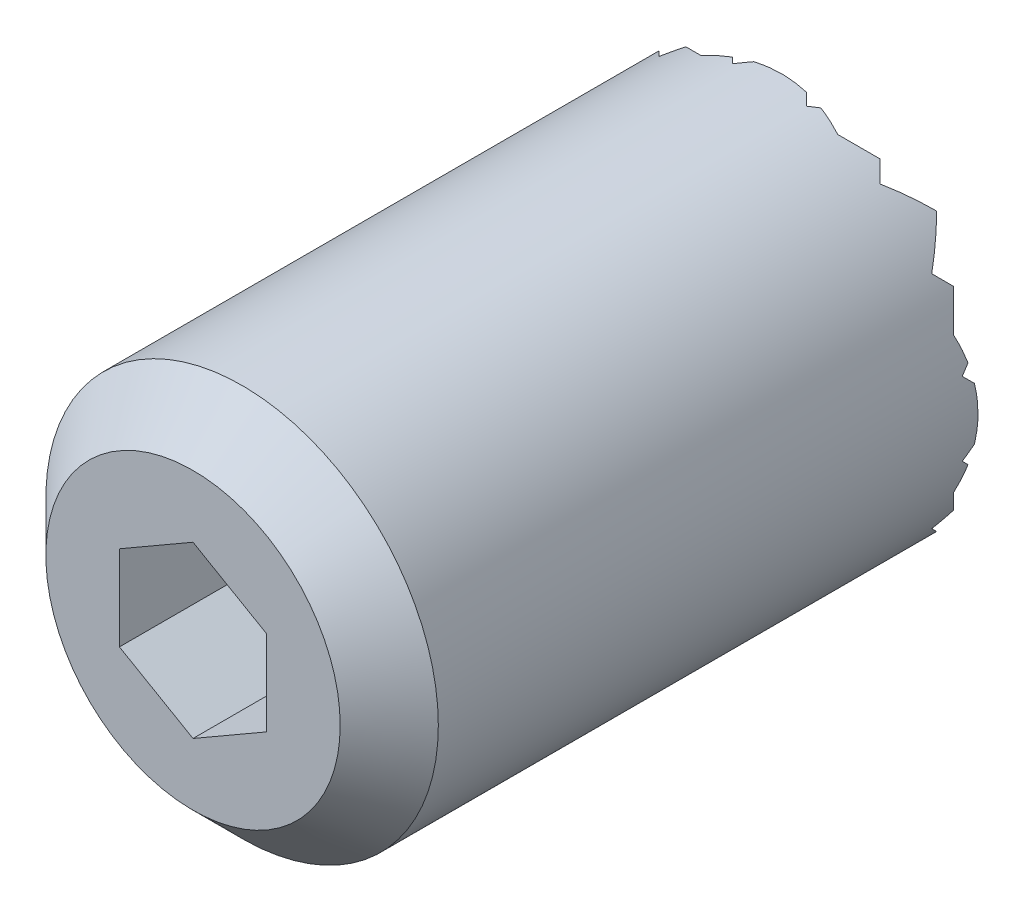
ISO-10303-21;
HEADER;
FILE_DESCRIPTION(('STEP AP214'),'2;1');
FILE_NAME('part.step','',(''),(''),'','','');
FILE_SCHEMA(('AUTOMOTIVE_DESIGN { 1 0 10303 214 1 1 1 1 }'));
ENDSEC;
DATA;
#1=APPLICATION_CONTEXT('core data for automotive mechanical design processes');
#2=APPLICATION_PROTOCOL_DEFINITION('international standard','automotive_design',2000,#1);
#3=PRODUCT_CONTEXT('',#1,'mechanical');
#4=PRODUCT('Part','Part','',(#3));
#5=PRODUCT_RELATED_PRODUCT_CATEGORY('part','',(#4));
#6=PRODUCT_DEFINITION_FORMATION('','',#4);
#7=PRODUCT_DEFINITION_CONTEXT('part definition',#1,'design');
#8=PRODUCT_DEFINITION('design','',#6,#7);
#9=PRODUCT_DEFINITION_SHAPE('','',#8);
#10=(LENGTH_UNIT() NAMED_UNIT(*) SI_UNIT(.MILLI.,.METRE.));
#11=(NAMED_UNIT(*) PLANE_ANGLE_UNIT() SI_UNIT($,.RADIAN.));
#12=(NAMED_UNIT(*) SI_UNIT($,.STERADIAN.) SOLID_ANGLE_UNIT());
#13=UNCERTAINTY_MEASURE_WITH_UNIT(LENGTH_MEASURE(1.E-05),#10,'distance_accuracy_value','');
#14=(GEOMETRIC_REPRESENTATION_CONTEXT(3) GLOBAL_UNCERTAINTY_ASSIGNED_CONTEXT((#13)) GLOBAL_UNIT_ASSIGNED_CONTEXT((#10,
#11,#12)) REPRESENTATION_CONTEXT('',''));
#15=CARTESIAN_POINT('',(0.,0.,0.));
#16=DIRECTION('',(0.,0.,1.));
#17=DIRECTION('',(1.,0.,0.));
#18=AXIS2_PLACEMENT_3D('',#15,#16,#17);
#19=CARTESIAN_POINT('',(3.,-10.,0.));
#20=DIRECTION('',(0.70710678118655,0.,0.707106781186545));
#21=DIRECTION('',(0.707106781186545,0.,-0.70710678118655));
#22=AXIS2_PLACEMENT_3D('',#19,#20,#21);
#23=PLANE('',#22);
#24=DIRECTION('',(0.,1.,0.));
#25=VECTOR('',#24,1.);
#26=CARTESIAN_POINT('',(1.5,-10.,1.5));
#27=LINE('',#26,#25);
#28=CARTESIAN_POINT('',(1.5,-7.85811682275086,1.5));
#29=VERTEX_POINT('',#28);
#30=CARTESIAN_POINT('',(1.5,-7.5,1.5));
#31=VERTEX_POINT('',#30);
#32=EDGE_CURVE('E693',#29,#31,#27,.T.);
#33=ORIENTED_EDGE('',*,*,#32,.T.);
#34=DIRECTION('',(0.577350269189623,-0.577350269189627,-0.577350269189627));
#35=VECTOR('',#34,1.);
#36=CARTESIAN_POINT('',(3.33333333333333,-9.33333333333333,-0.333333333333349));
#37=LINE('',#36,#35);
#38=CARTESIAN_POINT('',(1.79583152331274,-7.79583152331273,1.20416847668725));
#39=VERTEX_POINT('',#38);
#40=EDGE_CURVE('E690',#31,#39,#37,.T.);
#41=ORIENTED_EDGE('',*,*,#40,.T.);
#42=CARTESIAN_POINT('',(0.,0.,3.));
#43=DIRECTION('',(0.70710678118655,0.,0.707106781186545));
#44=DIRECTION('',(-0.707106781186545,0.,0.70710678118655));
#45=AXIS2_PLACEMENT_3D('',#42,#43,#44);
#46=ELLIPSE('',#45,11.3137084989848,8.);
#47=EDGE_CURVE('E797',#39,#29,#46,.F.);
#48=ORIENTED_EDGE('',*,*,#47,.T.);
#49=EDGE_LOOP('',(#33,#41,#48));
#50=FACE_BOUND('',#49,.T.);
#51=ADVANCED_FACE('F14',(#50),#23,.F.);
#52=CARTESIAN_POINT('',(1.5,7.85811682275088,1.5));
#53=VERTEX_POINT('',#52);
#54=CARTESIAN_POINT('',(1.79583152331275,7.79583152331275,1.20416847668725));
#55=VERTEX_POINT('',#54);
#56=EDGE_CURVE('E793',#53,#55,#46,.F.);
#57=ORIENTED_EDGE('',*,*,#56,.T.);
#58=DIRECTION('',(-0.577350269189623,-0.577350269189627,0.577350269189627));
#59=VECTOR('',#58,1.);
#60=CARTESIAN_POINT('',(-3.33333333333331,2.66666666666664,6.33333333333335));
#61=LINE('',#60,#59);
#62=CARTESIAN_POINT('',(1.5,7.5,1.5));
#63=VERTEX_POINT('',#62);
#64=EDGE_CURVE('E677',#55,#63,#61,.T.);
#65=ORIENTED_EDGE('',*,*,#64,.T.);
#66=EDGE_CURVE('E698',#63,#53,#27,.T.);
#67=ORIENTED_EDGE('',*,*,#66,.T.);
#68=EDGE_LOOP('',(#57,#65,#67));
#69=FACE_BOUND('',#68,.T.);
#70=ADVANCED_FACE('F1130',(#69),#23,.F.);
#71=CARTESIAN_POINT('',(1.5,-10.,1.5));
#72=DIRECTION('',(-0.707106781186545,0.,0.70710678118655));
#73=DIRECTION('',(0.70710678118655,0.,0.707106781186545));
#74=AXIS2_PLACEMENT_3D('',#71,#72,#73);
#75=PLANE('',#74);
#76=CARTESIAN_POINT('',(0.,0.,0.));
#77=DIRECTION('',(-0.707106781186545,0.,0.70710678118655));
#78=DIRECTION('',(0.70710678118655,0.,0.707106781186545));
#79=AXIS2_PLACEMENT_3D('',#76,#77,#78);
#80=ELLIPSE('',#79,11.3137084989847,8.);
#81=CARTESIAN_POINT('',(1.07217269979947,-7.92782730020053,1.07217269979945));
#82=VERTEX_POINT('',#81);
#83=EDGE_CURVE('E801',#29,#82,#80,.F.);
#84=ORIENTED_EDGE('',*,*,#83,.T.);
#85=DIRECTION('',(0.577350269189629,0.577350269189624,0.577350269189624));
#86=VECTOR('',#85,1.);
#87=CARTESIAN_POINT('',(0.666666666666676,-8.33333333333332,0.666666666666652));
#88=LINE('',#87,#86);
#89=EDGE_CURVE('E687',#82,#31,#88,.T.);
#90=ORIENTED_EDGE('',*,*,#89,.T.);
#91=ORIENTED_EDGE('',*,*,#32,.F.);
#92=EDGE_LOOP('',(#84,#90,#91));
#93=FACE_BOUND('',#92,.T.);
#94=ADVANCED_FACE('F1137',(#93),#75,.F.);
#95=ORIENTED_EDGE('',*,*,#66,.F.);
#96=DIRECTION('',(-0.577350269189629,0.577350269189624,-0.577350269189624));
#97=VECTOR('',#96,1.);
#98=CARTESIAN_POINT('',(7.33333333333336,1.66666666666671,7.3333333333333));
#99=LINE('',#98,#97);
#100=CARTESIAN_POINT('',(1.07217269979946,7.92782730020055,1.07217269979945));
#101=VERTEX_POINT('',#100);
#102=EDGE_CURVE('E674',#63,#101,#99,.T.);
#103=ORIENTED_EDGE('',*,*,#102,.T.);
#104=EDGE_CURVE('E798',#101,#53,#80,.F.);
#105=ORIENTED_EDGE('',*,*,#104,.T.);
#106=EDGE_LOOP('',(#95,#103,#105));
#107=FACE_BOUND('',#106,.T.);
#108=ADVANCED_FACE('F1155',(#107),#75,.F.);
#109=CARTESIAN_POINT('',(0.,-10.,0.));
#110=DIRECTION('',(0.70710678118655,0.,0.707106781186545));
#111=DIRECTION('',(0.707106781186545,0.,-0.70710678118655));
#112=AXIS2_PLACEMENT_3D('',#109,#110,#111);
#113=PLANE('',#112);
#114=DIRECTION('',(0.,1.,0.));
#115=VECTOR('',#114,1.);
#116=CARTESIAN_POINT('',(-1.5,-10.,1.5));
#117=LINE('',#116,#115);
#118=CARTESIAN_POINT('',(-1.5,-7.85811682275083,1.5));
#119=VERTEX_POINT('',#118);
#120=CARTESIAN_POINT('',(-1.5,-7.5,1.5));
#121=VERTEX_POINT('',#120);
#122=EDGE_CURVE('E699',#119,#121,#117,.T.);
#123=ORIENTED_EDGE('',*,*,#122,.T.);
#124=DIRECTION('',(0.577350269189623,-0.577350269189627,-0.577350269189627));
#125=VECTOR('',#124,1.);
#126=CARTESIAN_POINT('',(0.333333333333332,-9.33333333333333,-0.333333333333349));
#127=LINE('',#126,#125);
#128=CARTESIAN_POINT('',(-1.07217269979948,-7.9278273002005,1.0721726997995));
#129=VERTEX_POINT('',#128);
#130=EDGE_CURVE('E680',#121,#129,#127,.T.);
#131=ORIENTED_EDGE('',*,*,#130,.T.);
#132=CARTESIAN_POINT('',(0.,0.,0.));
#133=DIRECTION('',(0.70710678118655,0.,0.707106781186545));
#134=DIRECTION('',(-0.707106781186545,0.,0.70710678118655));
#135=AXIS2_PLACEMENT_3D('',#132,#133,#134);
#136=ELLIPSE('',#135,11.3137084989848,8.);
#137=EDGE_CURVE('E805',#129,#119,#136,.F.);
#138=ORIENTED_EDGE('',*,*,#137,.T.);
#139=EDGE_LOOP('',(#123,#131,#138));
#140=FACE_BOUND('',#139,.T.);
#141=ADVANCED_FACE('F1235',(#140),#113,.F.);
#142=CARTESIAN_POINT('',(-1.5,7.85811682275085,1.5));
#143=VERTEX_POINT('',#142);
#144=CARTESIAN_POINT('',(-1.07217269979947,7.92782730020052,1.0721726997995));
#145=VERTEX_POINT('',#144);
#146=EDGE_CURVE('E802',#143,#145,#136,.F.);
#147=ORIENTED_EDGE('',*,*,#146,.T.);
#148=DIRECTION('',(-0.577350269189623,-0.577350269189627,0.577350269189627));
#149=VECTOR('',#148,1.);
#150=CARTESIAN_POINT('',(-6.33333333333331,2.66666666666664,6.33333333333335));
#151=LINE('',#150,#149);
#152=CARTESIAN_POINT('',(-1.5,7.5,1.5));
#153=VERTEX_POINT('',#152);
#154=EDGE_CURVE('E667',#145,#153,#151,.T.);
#155=ORIENTED_EDGE('',*,*,#154,.T.);
#156=EDGE_CURVE('E703',#153,#143,#117,.T.);
#157=ORIENTED_EDGE('',*,*,#156,.T.);
#158=EDGE_LOOP('',(#147,#155,#157));
#159=FACE_BOUND('',#158,.T.);
#160=ADVANCED_FACE('F866',(#159),#113,.F.);
#161=CARTESIAN_POINT('',(-1.5,-10.,1.5));
#162=DIRECTION('',(-0.707106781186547,0.,0.707106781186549));
#163=DIRECTION('',(0.707106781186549,0.,0.707106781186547));
#164=AXIS2_PLACEMENT_3D('',#161,#162,#163);
#165=PLANE('',#164);
#166=CARTESIAN_POINT('',(0.,0.,3.));
#167=DIRECTION('',(-0.707106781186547,0.,0.707106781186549));
#168=DIRECTION('',(0.707106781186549,0.,0.707106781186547));
#169=AXIS2_PLACEMENT_3D('',#166,#167,#168);
#170=ELLIPSE('',#169,11.3137084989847,8.);
#171=CARTESIAN_POINT('',(-1.79583152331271,-7.79583152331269,1.2041684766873));
#172=VERTEX_POINT('',#171);
#173=EDGE_CURVE('E809',#119,#172,#170,.F.);
#174=ORIENTED_EDGE('',*,*,#173,.T.);
#175=DIRECTION('',(0.577350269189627,0.577350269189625,0.577350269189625));
#176=VECTOR('',#175,1.);
#177=CARTESIAN_POINT('',(-2.33333333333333,-8.33333333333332,0.666666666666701));
#178=LINE('',#177,#176);
#179=EDGE_CURVE('E9',#172,#121,#178,.T.);
#180=ORIENTED_EDGE('',*,*,#179,.T.);
#181=ORIENTED_EDGE('',*,*,#122,.F.);
#182=EDGE_LOOP('',(#174,#180,#181));
#183=FACE_BOUND('',#182,.T.);
#184=ADVANCED_FACE('F1294',(#183),#165,.F.);
#185=ORIENTED_EDGE('',*,*,#156,.F.);
#186=DIRECTION('',(-0.577350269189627,0.577350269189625,-0.577350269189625));
#187=VECTOR('',#186,1.);
#188=CARTESIAN_POINT('',(4.33333333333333,1.66666666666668,7.33333333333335));
#189=LINE('',#188,#187);
#190=CARTESIAN_POINT('',(-1.79583152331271,7.79583152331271,1.2041684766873));
#191=VERTEX_POINT('',#190);
#192=EDGE_CURVE('E22',#153,#191,#189,.T.);
#193=ORIENTED_EDGE('',*,*,#192,.T.);
#194=EDGE_CURVE('E806',#191,#143,#170,.F.);
#195=ORIENTED_EDGE('',*,*,#194,.T.);
#196=EDGE_LOOP('',(#185,#193,#195));
#197=FACE_BOUND('',#196,.T.);
#198=ADVANCED_FACE('F851',(#197),#165,.F.);
#199=CARTESIAN_POINT('',(-3.,-10.,0.));
#200=DIRECTION('',(0.70710678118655,0.,0.707106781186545));
#201=DIRECTION('',(0.707106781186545,0.,-0.70710678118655));
#202=AXIS2_PLACEMENT_3D('',#199,#200,#201);
#203=PLANE('',#202);
#204=DIRECTION('',(0.577350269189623,-0.577350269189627,-0.577350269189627));
#205=VECTOR('',#204,1.);
#206=CARTESIAN_POINT('',(-1.66666666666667,-7.33333333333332,-1.33333333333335));
#207=LINE('',#206,#205);
#208=CARTESIAN_POINT('',(-4.5,-4.5,1.5));
#209=VERTEX_POINT('',#208);
#210=CARTESIAN_POINT('',(-3.,-6.,0.));
#211=VERTEX_POINT('',#210);
#212=EDGE_CURVE('E501',#209,#211,#207,.T.);
#213=ORIENTED_EDGE('',*,*,#212,.T.);
#214=DIRECTION('',(-0.577350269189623,-0.577350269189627,0.577350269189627));
#215=VECTOR('',#214,1.);
#216=CARTESIAN_POINT('',(-4.33333333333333,-7.33333333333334,1.33333333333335));
#217=LINE('',#216,#215);
#218=CARTESIAN_POINT('',(-3.9543560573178,-6.95435605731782,0.954356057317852));
#219=VERTEX_POINT('',#218);
#220=EDGE_CURVE('E481',#211,#219,#217,.T.);
#221=ORIENTED_EDGE('',*,*,#220,.T.);
#222=CARTESIAN_POINT('',(0.,0.,-3.));
#223=DIRECTION('',(0.70710678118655,0.,0.707106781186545));
#224=DIRECTION('',(-0.707106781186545,0.,0.70710678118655));
#225=AXIS2_PLACEMENT_3D('',#222,#223,#224);
#226=ELLIPSE('',#225,11.3137084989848,8.);
#227=CARTESIAN_POINT('',(-4.5,-6.61437827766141,1.5));
#228=VERTEX_POINT('',#227);
#229=EDGE_CURVE('E389',#219,#228,#226,.F.);
#230=ORIENTED_EDGE('',*,*,#229,.T.);
#231=DIRECTION('',(0.,1.,0.));
#232=VECTOR('',#231,1.);
#233=CARTESIAN_POINT('',(-4.5,-10.,1.5));
#234=LINE('',#233,#232);
#235=EDGE_CURVE('E704',#228,#209,#234,.T.);
#236=ORIENTED_EDGE('',*,*,#235,.T.);
#237=EDGE_LOOP('',(#213,#221,#230,#236));
#238=FACE_BOUND('',#237,.T.);
#239=ADVANCED_FACE('F1290',(#238),#203,.F.);
#240=CARTESIAN_POINT('',(-4.5,6.61437827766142,1.5));
#241=VERTEX_POINT('',#240);
#242=CARTESIAN_POINT('',(-3.95435605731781,6.95435605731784,0.954356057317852));
#243=VERTEX_POINT('',#242);
#244=EDGE_CURVE('E810',#241,#243,#226,.F.);
#245=ORIENTED_EDGE('',*,*,#244,.T.);
#246=DIRECTION('',(0.577350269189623,-0.577350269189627,-0.577350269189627));
#247=VECTOR('',#246,1.);
#248=CARTESIAN_POINT('',(2.33333333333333,0.666666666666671,-5.33333333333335));
#249=LINE('',#248,#247);
#250=CARTESIAN_POINT('',(-3.,6.,0.));
#251=VERTEX_POINT('',#250);
#252=EDGE_CURVE('E464',#243,#251,#249,.T.);
#253=ORIENTED_EDGE('',*,*,#252,.T.);
#254=DIRECTION('',(-0.577350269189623,-0.577350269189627,0.577350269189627));
#255=VECTOR('',#254,1.);
#256=CARTESIAN_POINT('',(-8.33333333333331,0.666666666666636,5.33333333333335));
#257=LINE('',#256,#255);
#258=CARTESIAN_POINT('',(-4.5,4.5,1.5));
#259=VERTEX_POINT('',#258);
#260=EDGE_CURVE('E444',#251,#259,#257,.T.);
#261=ORIENTED_EDGE('',*,*,#260,.T.);
#262=EDGE_CURVE('E708',#259,#241,#234,.T.);
#263=ORIENTED_EDGE('',*,*,#262,.T.);
#264=EDGE_LOOP('',(#245,#253,#261,#263));
#265=FACE_BOUND('',#264,.T.);
#266=ADVANCED_FACE('F1291',(#265),#203,.F.);
#267=CARTESIAN_POINT('',(-4.5,-10.,1.5));
#268=DIRECTION('',(-0.707106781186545,0.,0.70710678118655));
#269=DIRECTION('',(0.70710678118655,0.,0.707106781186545));
#270=AXIS2_PLACEMENT_3D('',#267,#268,#269);
#271=PLANE('',#270);
#272=CARTESIAN_POINT('',(0.,0.,6.));
#273=DIRECTION('',(-0.707106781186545,0.,0.70710678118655));
#274=DIRECTION('',(0.70710678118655,0.,0.707106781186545));
#275=AXIS2_PLACEMENT_3D('',#272,#273,#274);
#276=ELLIPSE('',#275,11.3137084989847,8.);
#277=CARTESIAN_POINT('',(-5.65685424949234,-5.65685424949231,0.3431457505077));
#278=VERTEX_POINT('',#277);
#279=EDGE_CURVE('E816',#228,#278,#276,.F.);
#280=ORIENTED_EDGE('',*,*,#279,.T.);
#281=DIRECTION('',(0.577350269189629,0.577350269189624,0.577350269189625));
#282=VECTOR('',#281,1.);
#283=CARTESIAN_POINT('',(-6.33333333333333,-6.3333333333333,-0.3333333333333));
#284=LINE('',#283,#282);
#285=EDGE_CURVE('E503',#278,#209,#284,.T.);
#286=ORIENTED_EDGE('',*,*,#285,.T.);
#287=ORIENTED_EDGE('',*,*,#235,.F.);
#288=EDGE_LOOP('',(#280,#286,#287));
#289=FACE_BOUND('',#288,.T.);
#290=ADVANCED_FACE('F1284',(#289),#271,.F.);
#291=ORIENTED_EDGE('',*,*,#262,.F.);
#292=DIRECTION('',(-0.577350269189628,0.577350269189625,-0.577350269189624));
#293=VECTOR('',#292,1.);
#294=CARTESIAN_POINT('',(0.333333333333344,-0.333333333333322,6.3333333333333));
#295=LINE('',#294,#293);
#296=CARTESIAN_POINT('',(-5.65685424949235,5.65685424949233,0.3431457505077));
#297=VERTEX_POINT('',#296);
#298=EDGE_CURVE('E447',#259,#297,#295,.T.);
#299=ORIENTED_EDGE('',*,*,#298,.T.);
#300=EDGE_CURVE('E813',#297,#241,#276,.F.);
#301=ORIENTED_EDGE('',*,*,#300,.T.);
#302=EDGE_LOOP('',(#291,#299,#301));
#303=FACE_BOUND('',#302,.T.);
#304=ADVANCED_FACE('F1285',(#303),#271,.F.);
#305=CARTESIAN_POINT('',(-6.,-10.,0.));
#306=DIRECTION('',(0.70710678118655,0.,0.707106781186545));
#307=DIRECTION('',(0.707106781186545,0.,-0.70710678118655));
#308=AXIS2_PLACEMENT_3D('',#305,#306,#307);
#309=PLANE('',#308);
#310=DIRECTION('',(0.577350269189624,-0.577350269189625,-0.577350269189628));
#311=VECTOR('',#310,1.);
#312=CARTESIAN_POINT('',(-3.66666666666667,-5.3333333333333,-2.3333333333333));
#313=LINE('',#312,#311);
#314=CARTESIAN_POINT('',(-7.5,-1.5,1.5));
#315=VERTEX_POINT('',#314);
#316=CARTESIAN_POINT('',(-6.,-3.,0.));
#317=VERTEX_POINT('',#316);
#318=EDGE_CURVE('E564',#315,#317,#313,.T.);
#319=ORIENTED_EDGE('',*,*,#318,.T.);
#320=DIRECTION('',(-0.577350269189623,-0.577350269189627,0.577350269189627));
#321=VECTOR('',#320,1.);
#322=CARTESIAN_POINT('',(-8.33333333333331,-5.33333333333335,2.33333333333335));
#323=LINE('',#322,#321);
#324=CARTESIAN_POINT('',(-6.95435605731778,-3.95435605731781,0.9543560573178));
#325=VERTEX_POINT('',#324);
#326=EDGE_CURVE('E533',#317,#325,#323,.T.);
#327=ORIENTED_EDGE('',*,*,#326,.T.);
#328=CARTESIAN_POINT('',(0.,0.,-6.));
#329=DIRECTION('',(0.70710678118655,0.,0.707106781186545));
#330=DIRECTION('',(-0.707106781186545,0.,0.70710678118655));
#331=AXIS2_PLACEMENT_3D('',#328,#329,#330);
#332=ELLIPSE('',#331,11.3137084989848,8.);
#333=CARTESIAN_POINT('',(-7.5,-2.78388218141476,1.5));
#334=VERTEX_POINT('',#333);
#335=EDGE_CURVE('E820',#325,#334,#332,.F.);
#336=ORIENTED_EDGE('',*,*,#335,.T.);
#337=DIRECTION('',(0.,1.,0.));
#338=VECTOR('',#337,1.);
#339=CARTESIAN_POINT('',(-7.5,-10.,1.5));
#340=LINE('',#339,#338);
#341=EDGE_CURVE('E709',#334,#315,#340,.T.);
#342=ORIENTED_EDGE('',*,*,#341,.T.);
#343=EDGE_LOOP('',(#319,#327,#336,#342));
#344=FACE_BOUND('',#343,.T.);
#345=ADVANCED_FACE('F1275',(#344),#309,.F.);
#346=DIRECTION('',(0.577350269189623,-0.577350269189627,-0.577350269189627));
#347=VECTOR('',#346,1.);
#348=CARTESIAN_POINT('',(-2.66666666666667,-3.33333333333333,-3.33333333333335));
#349=LINE('',#348,#347);
#350=CARTESIAN_POINT('',(-7.5,1.5,1.5));
#351=VERTEX_POINT('',#350);
#352=CARTESIAN_POINT('',(-6.,0.,0.));
#353=VERTEX_POINT('',#352);
#354=EDGE_CURVE('E631',#351,#353,#349,.T.);
#355=ORIENTED_EDGE('',*,*,#354,.T.);
#356=DIRECTION('',(-0.577350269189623,-0.577350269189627,0.577350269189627));
#357=VECTOR('',#356,1.);
#358=CARTESIAN_POINT('',(-9.33333333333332,-3.33333333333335,3.33333333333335));
#359=LINE('',#358,#357);
#360=EDGE_CURVE('E598',#353,#315,#359,.T.);
#361=ORIENTED_EDGE('',*,*,#360,.T.);
#362=EDGE_CURVE('E712',#315,#351,#340,.T.);
#363=ORIENTED_EDGE('',*,*,#362,.T.);
#364=EDGE_LOOP('',(#355,#361,#363));
#365=FACE_BOUND('',#364,.T.);
#366=ADVANCED_FACE('F1268',(#365),#309,.F.);
#367=CARTESIAN_POINT('',(-7.5,-10.,1.5));
#368=DIRECTION('',(-0.707106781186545,0.,0.70710678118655));
#369=DIRECTION('',(0.70710678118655,0.,0.707106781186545));
#370=AXIS2_PLACEMENT_3D('',#367,#368,#369);
#371=PLANE('',#370);
#372=CARTESIAN_POINT('',(-7.5,2.78388218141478,1.5));
#373=VERTEX_POINT('',#372);
#374=EDGE_CURVE('E713',#351,#373,#340,.T.);
#375=ORIENTED_EDGE('',*,*,#374,.F.);
#376=DIRECTION('',(-0.577350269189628,0.577350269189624,-0.577350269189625));
#377=VECTOR('',#376,1.);
#378=CARTESIAN_POINT('',(-3.66666666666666,-2.33333333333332,5.33333333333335));
#379=LINE('',#378,#377);
#380=CARTESIAN_POINT('',(-7.79583152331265,1.79583152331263,1.2041684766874));
#381=VERTEX_POINT('',#380);
#382=EDGE_CURVE('E664',#351,#381,#379,.T.);
#383=ORIENTED_EDGE('',*,*,#382,.T.);
#384=CARTESIAN_POINT('',(0.,0.,9.));
#385=DIRECTION('',(-0.707106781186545,0.,0.70710678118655));
#386=DIRECTION('',(0.70710678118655,0.,0.707106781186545));
#387=AXIS2_PLACEMENT_3D('',#384,#385,#386);
#388=ELLIPSE('',#387,11.3137084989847,8.);
#389=EDGE_CURVE('E824',#381,#373,#388,.F.);
#390=ORIENTED_EDGE('',*,*,#389,.T.);
#391=EDGE_LOOP('',(#375,#383,#390));
#392=FACE_BOUND('',#391,.T.);
#393=ADVANCED_FACE('F1125',(#392),#371,.F.);
#394=CARTESIAN_POINT('',(-7.92782730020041,-1.07217269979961,1.0721726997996));
#395=VERTEX_POINT('',#394);
#396=CARTESIAN_POINT('',(-7.92782730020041,1.07217269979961,1.0721726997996));
#397=VERTEX_POINT('',#396);
#398=EDGE_CURVE('E823',#395,#397,#388,.F.);
#399=ORIENTED_EDGE('',*,*,#398,.T.);
#400=DIRECTION('',(0.577350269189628,0.577350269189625,0.577350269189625));
#401=VECTOR('',#400,1.);
#402=CARTESIAN_POINT('',(-11.3333333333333,-2.33333333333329,-2.3333333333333));
#403=LINE('',#402,#401);
#404=EDGE_CURVE('E633',#397,#351,#403,.T.);
#405=ORIENTED_EDGE('',*,*,#404,.T.);
#406=ORIENTED_EDGE('',*,*,#362,.F.);
#407=DIRECTION('',(-0.577350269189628,0.577350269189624,-0.577350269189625));
#408=VECTOR('',#407,1.);
#409=CARTESIAN_POINT('',(-4.66666666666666,-4.33333333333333,4.33333333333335));
#410=LINE('',#409,#408);
#411=EDGE_CURVE('E601',#315,#395,#410,.T.);
#412=ORIENTED_EDGE('',*,*,#411,.T.);
#413=EDGE_LOOP('',(#399,#405,#406,#412));
#414=FACE_BOUND('',#413,.T.);
#415=ADVANCED_FACE('F1126',(#414),#371,.F.);
#416=CARTESIAN_POINT('',(9.0000000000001,-10.,0.));
#417=DIRECTION('',(0.707106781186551,0.,0.707106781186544));
#418=DIRECTION('',(0.707106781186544,0.,-0.707106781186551));
#419=AXIS2_PLACEMENT_3D('',#416,#417,#418);
#420=PLANE('',#419);
#421=CARTESIAN_POINT('',(0.,0.,9.));
#422=DIRECTION('',(0.707106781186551,0.,0.707106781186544));
#423=DIRECTION('',(-0.707106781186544,0.,0.707106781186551));
#424=AXIS2_PLACEMENT_3D('',#421,#422,#423);
#425=ELLIPSE('',#424,11.3137084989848,8.);
#426=CARTESIAN_POINT('',(7.5,2.78388218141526,1.5));
#427=VERTEX_POINT('',#426);
#428=CARTESIAN_POINT('',(7.7958315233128,1.79583152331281,1.2041684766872));
#429=VERTEX_POINT('',#428);
#430=EDGE_CURVE('E790',#427,#429,#425,.F.);
#431=ORIENTED_EDGE('',*,*,#430,.T.);
#432=DIRECTION('',(-0.577350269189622,-0.577350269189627,0.577350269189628));
#433=VECTOR('',#432,1.);
#434=CARTESIAN_POINT('',(4.66666666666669,-1.33333333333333,4.33333333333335));
#435=LINE('',#434,#433);
#436=CARTESIAN_POINT('',(7.5000000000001,1.5,1.5));
#437=VERTEX_POINT('',#436);
#438=EDGE_CURVE('E374',#429,#437,#435,.T.);
#439=ORIENTED_EDGE('',*,*,#438,.T.);
#440=DIRECTION('',(0.,1.,0.));
#441=VECTOR('',#440,1.);
#442=CARTESIAN_POINT('',(7.5,-10.,1.5));
#443=LINE('',#442,#441);
#444=EDGE_CURVE('E718',#437,#427,#443,.T.);
#445=ORIENTED_EDGE('',*,*,#444,.T.);
#446=EDGE_LOOP('',(#431,#439,#445));
#447=FACE_BOUND('',#446,.T.);
#448=ADVANCED_FACE('F1094',(#447),#420,.F.);
#449=CARTESIAN_POINT('',(7.5000000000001,-1.5,1.5));
#450=VERTEX_POINT('',#449);
#451=EDGE_CURVE('E717',#450,#437,#443,.T.);
#452=ORIENTED_EDGE('',*,*,#451,.T.);
#453=DIRECTION('',(0.577350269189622,-0.577350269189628,-0.577350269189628));
#454=VECTOR('',#453,1.);
#455=CARTESIAN_POINT('',(12.3333333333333,-3.33333333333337,-3.33333333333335));
#456=LINE('',#455,#454);
#457=CARTESIAN_POINT('',(7.92782730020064,1.07217269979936,1.07217269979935));
#458=VERTEX_POINT('',#457);
#459=EDGE_CURVE('E610',#437,#458,#456,.T.);
#460=ORIENTED_EDGE('',*,*,#459,.T.);
#461=CARTESIAN_POINT('',(7.92782730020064,-1.07217269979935,1.07217269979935));
#462=VERTEX_POINT('',#461);
#463=EDGE_CURVE('E794',#458,#462,#425,.F.);
#464=ORIENTED_EDGE('',*,*,#463,.T.);
#465=DIRECTION('',(-0.577350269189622,-0.577350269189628,0.577350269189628));
#466=VECTOR('',#465,1.);
#467=CARTESIAN_POINT('',(5.66666666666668,-3.33333333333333,3.33333333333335));
#468=LINE('',#467,#466);
#469=EDGE_CURVE('E575',#462,#450,#468,.T.);
#470=ORIENTED_EDGE('',*,*,#469,.T.);
#471=EDGE_LOOP('',(#452,#460,#464,#470));
#472=FACE_BOUND('',#471,.T.);
#473=ADVANCED_FACE('F1100',(#472),#420,.F.);
#474=CARTESIAN_POINT('',(7.5,-10.,1.5));
#475=DIRECTION('',(-0.707106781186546,0.,0.70710678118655));
#476=DIRECTION('',(0.70710678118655,0.,0.707106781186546));
#477=AXIS2_PLACEMENT_3D('',#474,#475,#476);
#478=PLANE('',#477);
#479=CARTESIAN_POINT('',(0.,0.,-6.));
#480=DIRECTION('',(-0.707106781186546,0.,0.70710678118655));
#481=DIRECTION('',(0.70710678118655,0.,0.707106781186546));
#482=AXIS2_PLACEMENT_3D('',#479,#480,#481);
#483=ELLIPSE('',#482,11.3137084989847,8.);
#484=CARTESIAN_POINT('',(7.5,-2.78388218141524,1.5));
#485=VERTEX_POINT('',#484);
#486=CARTESIAN_POINT('',(6.95435605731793,-3.9543560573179,0.9543560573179));
#487=VERTEX_POINT('',#486);
#488=EDGE_CURVE('E789',#485,#487,#483,.F.);
#489=ORIENTED_EDGE('',*,*,#488,.T.);
#490=DIRECTION('',(-0.577350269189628,0.577350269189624,-0.577350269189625));
#491=VECTOR('',#490,1.);
#492=CARTESIAN_POINT('',(9.33333333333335,-6.33333333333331,3.33333333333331));
#493=LINE('',#492,#491);
#494=CARTESIAN_POINT('',(6.,-3.,0.));
#495=VERTEX_POINT('',#494);
#496=EDGE_CURVE('E509',#487,#495,#493,.T.);
#497=ORIENTED_EDGE('',*,*,#496,.T.);
#498=DIRECTION('',(0.577350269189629,0.577350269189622,0.577350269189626));
#499=VECTOR('',#498,1.);
#500=CARTESIAN_POINT('',(4.66666666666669,-4.33333333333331,-1.3333333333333));
#501=LINE('',#500,#499);
#502=EDGE_CURVE('E539',#495,#450,#501,.T.);
#503=ORIENTED_EDGE('',*,*,#502,.T.);
#504=EDGE_CURVE('E714',#485,#450,#443,.T.);
#505=ORIENTED_EDGE('',*,*,#504,.F.);
#506=EDGE_LOOP('',(#489,#497,#503,#505));
#507=FACE_BOUND('',#506,.T.);
#508=ADVANCED_FACE('F948',(#507),#478,.F.);
#509=ORIENTED_EDGE('',*,*,#451,.F.);
#510=DIRECTION('',(-0.577350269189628,0.577350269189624,-0.577350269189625));
#511=VECTOR('',#510,1.);
#512=CARTESIAN_POINT('',(10.3333333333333,-4.33333333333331,4.33333333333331));
#513=LINE('',#512,#511);
#514=CARTESIAN_POINT('',(6.,0.,0.));
#515=VERTEX_POINT('',#514);
#516=EDGE_CURVE('E572',#450,#515,#513,.T.);
#517=ORIENTED_EDGE('',*,*,#516,.T.);
#518=DIRECTION('',(0.577350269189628,0.577350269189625,0.577350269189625));
#519=VECTOR('',#518,1.);
#520=CARTESIAN_POINT('',(3.66666666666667,-2.33333333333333,-2.3333333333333));
#521=LINE('',#520,#519);
#522=EDGE_CURVE('E607',#515,#437,#521,.T.);
#523=ORIENTED_EDGE('',*,*,#522,.T.);
#524=EDGE_LOOP('',(#509,#517,#523));
#525=FACE_BOUND('',#524,.T.);
#526=ADVANCED_FACE('F1097',(#525),#478,.F.);
#527=CARTESIAN_POINT('',(6.,-10.,0.));
#528=DIRECTION('',(0.707106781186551,0.,0.707106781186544));
#529=DIRECTION('',(0.707106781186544,0.,-0.707106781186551));
#530=AXIS2_PLACEMENT_3D('',#527,#528,#529);
#531=PLANE('',#530);
#532=DIRECTION('',(0.,1.,0.));
#533=VECTOR('',#532,1.);
#534=CARTESIAN_POINT('',(4.5,-10.,1.5));
#535=LINE('',#534,#533);
#536=CARTESIAN_POINT('',(4.5,-6.61437827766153,1.5));
#537=VERTEX_POINT('',#536);
#538=CARTESIAN_POINT('',(4.5,-4.5,1.5));
#539=VERTEX_POINT('',#538);
#540=EDGE_CURVE('E719',#537,#539,#535,.T.);
#541=ORIENTED_EDGE('',*,*,#540,.T.);
#542=DIRECTION('',(0.577350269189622,-0.577350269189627,-0.577350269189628));
#543=VECTOR('',#542,1.);
#544=CARTESIAN_POINT('',(7.33333333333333,-7.33333333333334,-1.33333333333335));
#545=LINE('',#544,#543);
#546=CARTESIAN_POINT('',(5.65685424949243,-5.65685424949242,0.343145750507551));
#547=VERTEX_POINT('',#546);
#548=EDGE_CURVE('E484',#539,#547,#545,.T.);
#549=ORIENTED_EDGE('',*,*,#548,.T.);
#550=CARTESIAN_POINT('',(0.,0.,6.));
#551=DIRECTION('',(0.707106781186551,0.,0.707106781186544));
#552=DIRECTION('',(-0.707106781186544,0.,0.707106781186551));
#553=AXIS2_PLACEMENT_3D('',#550,#551,#552);
#554=ELLIPSE('',#553,11.3137084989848,8.);
#555=EDGE_CURVE('E785',#547,#537,#554,.F.);
#556=ORIENTED_EDGE('',*,*,#555,.T.);
#557=EDGE_LOOP('',(#541,#549,#556));
#558=FACE_BOUND('',#557,.T.);
#559=ADVANCED_FACE('F1613',(#558),#531,.F.);
#560=CARTESIAN_POINT('',(4.5,6.61437827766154,1.5));
#561=VERTEX_POINT('',#560);
#562=CARTESIAN_POINT('',(5.65685424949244,5.65685424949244,0.343145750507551));
#563=VERTEX_POINT('',#562);
#564=EDGE_CURVE('E780',#561,#563,#554,.F.);
#565=ORIENTED_EDGE('',*,*,#564,.T.);
#566=DIRECTION('',(-0.577350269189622,-0.577350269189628,0.577350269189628));
#567=VECTOR('',#566,1.);
#568=CARTESIAN_POINT('',(0.666666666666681,0.66666666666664,5.33333333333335));
#569=LINE('',#568,#567);
#570=CARTESIAN_POINT('',(4.5,4.5,1.5));
#571=VERTEX_POINT('',#570);
#572=EDGE_CURVE('E426',#563,#571,#569,.T.);
#573=ORIENTED_EDGE('',*,*,#572,.T.);
#574=EDGE_CURVE('E723',#571,#561,#535,.T.);
#575=ORIENTED_EDGE('',*,*,#574,.T.);
#576=EDGE_LOOP('',(#565,#573,#575));
#577=FACE_BOUND('',#576,.T.);
#578=ADVANCED_FACE('F1225',(#577),#531,.F.);
#579=CARTESIAN_POINT('',(4.5,-10.,1.5));
#580=DIRECTION('',(-0.707106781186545,0.,0.70710678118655));
#581=DIRECTION('',(0.70710678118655,0.,0.707106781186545));
#582=AXIS2_PLACEMENT_3D('',#579,#580,#581);
#583=PLANE('',#582);
#584=CARTESIAN_POINT('',(0.,0.,-3.));
#585=DIRECTION('',(-0.707106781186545,0.,0.70710678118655));
#586=DIRECTION('',(0.70710678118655,0.,0.707106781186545));
#587=AXIS2_PLACEMENT_3D('',#584,#585,#586);
#588=ELLIPSE('',#587,11.3137084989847,8.);
#589=CARTESIAN_POINT('',(3.9543560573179,-6.95435605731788,0.9543560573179));
#590=VERTEX_POINT('',#589);
#591=EDGE_CURVE('E781',#537,#590,#588,.F.);
#592=ORIENTED_EDGE('',*,*,#591,.T.);
#593=DIRECTION('',(-0.577350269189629,0.577350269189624,-0.577350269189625));
#594=VECTOR('',#593,1.);
#595=CARTESIAN_POINT('',(5.33333333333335,-8.33333333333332,2.33333333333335));
#596=LINE('',#595,#594);
#597=CARTESIAN_POINT('',(3.,-6.,0.));
#598=VERTEX_POINT('',#597);
#599=EDGE_CURVE('E844',#590,#598,#596,.T.);
#600=ORIENTED_EDGE('',*,*,#599,.T.);
#601=DIRECTION('',(0.577350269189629,0.577350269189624,0.577350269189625));
#602=VECTOR('',#601,1.);
#603=CARTESIAN_POINT('',(2.66666666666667,-6.33333333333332,-0.3333333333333));
#604=LINE('',#603,#602);
#605=EDGE_CURVE('E841',#598,#539,#604,.T.);
#606=ORIENTED_EDGE('',*,*,#605,.T.);
#607=ORIENTED_EDGE('',*,*,#540,.F.);
#608=EDGE_LOOP('',(#592,#600,#606,#607));
#609=FACE_BOUND('',#608,.T.);
#610=ADVANCED_FACE('F1606',(#609),#583,.F.);
#611=DIRECTION('',(-0.577350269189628,0.577350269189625,-0.577350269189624));
#612=VECTOR('',#611,1.);
#613=CARTESIAN_POINT('',(9.33333333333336,-0.333333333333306,6.3333333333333));
#614=LINE('',#613,#612);
#615=CARTESIAN_POINT('',(3.,6.,0.));
#616=VERTEX_POINT('',#615);
#617=EDGE_CURVE('E388',#571,#616,#614,.T.);
#618=ORIENTED_EDGE('',*,*,#617,.T.);
#619=DIRECTION('',(0.577350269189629,0.577350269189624,0.577350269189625));
#620=VECTOR('',#619,1.);
#621=CARTESIAN_POINT('',(-1.33333333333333,1.66666666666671,-4.3333333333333));
#622=LINE('',#621,#620);
#623=CARTESIAN_POINT('',(3.9543560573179,6.9543560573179,0.9543560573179));
#624=VERTEX_POINT('',#623);
#625=EDGE_CURVE('E395',#616,#624,#622,.T.);
#626=ORIENTED_EDGE('',*,*,#625,.T.);
#627=EDGE_CURVE('E777',#624,#561,#588,.F.);
#628=ORIENTED_EDGE('',*,*,#627,.T.);
#629=ORIENTED_EDGE('',*,*,#574,.F.);
#630=EDGE_LOOP('',(#618,#626,#628,#629));
#631=FACE_BOUND('',#630,.T.);
#632=ADVANCED_FACE('F1220',(#631),#583,.F.);
#633=CARTESIAN_POINT('',(0.,0.,45.));
#634=DIRECTION('',(0.,0.,1.));
#635=DIRECTION('',(1.,0.,0.));
#636=AXIS2_PLACEMENT_3D('',#633,#634,#635);
#637=CYLINDRICAL_SURFACE('',#636,8.);
#638=CARTESIAN_POINT('',(0.,0.,3.));
#639=DIRECTION('',(0.,0.707106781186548,0.707106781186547));
#640=DIRECTION('',(0.,-0.707106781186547,0.707106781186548));
#641=AXIS2_PLACEMENT_3D('',#638,#639,#640);
#642=ELLIPSE('',#641,11.3137084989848,8.);
#643=CARTESIAN_POINT('',(7.85811682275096,1.5,1.5));
#644=VERTEX_POINT('',#643);
#645=EDGE_CURVE('E373',#429,#644,#642,.F.);
#646=ORIENTED_EDGE('',*,*,#645,.F.);
#647=ORIENTED_EDGE('',*,*,#430,.F.);
#648=CARTESIAN_POINT('',(6.95435605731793,3.95435605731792,0.9543560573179));
#649=VERTEX_POINT('',#648);
#650=EDGE_CURVE('E784',#649,#427,#483,.F.);
#651=ORIENTED_EDGE('',*,*,#650,.F.);
#652=CARTESIAN_POINT('',(0.,0.,-3.));
#653=DIRECTION('',(0.,-0.707106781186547,0.707106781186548));
#654=DIRECTION('',(0.,0.707106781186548,0.707106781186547));
#655=AXIS2_PLACEMENT_3D('',#652,#653,#654);
#656=ELLIPSE('',#655,11.3137084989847,8.);
#657=CARTESIAN_POINT('',(6.61437827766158,4.5,1.5));
#658=VERTEX_POINT('',#657);
#659=EDGE_CURVE('E400',#658,#649,#656,.F.);
#660=ORIENTED_EDGE('',*,*,#659,.F.);
#661=CARTESIAN_POINT('',(0.,0.,6.));
#662=DIRECTION('',(0.,0.707106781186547,0.707106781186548));
#663=DIRECTION('',(0.,-0.707106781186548,0.707106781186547));
#664=AXIS2_PLACEMENT_3D('',#661,#662,#663);
#665=ELLIPSE('',#664,11.3137084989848,8.);
#666=EDGE_CURVE('E432',#563,#658,#665,.F.);
#667=ORIENTED_EDGE('',*,*,#666,.F.);
#668=ORIENTED_EDGE('',*,*,#564,.F.);
#669=ORIENTED_EDGE('',*,*,#627,.F.);
#670=CARTESIAN_POINT('',(0.,0.,-6.));
#671=DIRECTION('',(0.,-0.707106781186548,0.707106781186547));
#672=DIRECTION('',(0.,0.707106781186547,0.707106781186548));
#673=AXIS2_PLACEMENT_3D('',#670,#671,#672);
#674=ELLIPSE('',#673,11.3137084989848,8.);
#675=CARTESIAN_POINT('',(2.78388218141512,7.5,1.5));
#676=VERTEX_POINT('',#675);
#677=EDGE_CURVE('E453',#676,#624,#674,.F.);
#678=ORIENTED_EDGE('',*,*,#677,.F.);
#679=CARTESIAN_POINT('',(0.,0.,9.));
#680=DIRECTION('',(0.,0.707106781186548,0.707106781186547));
#681=DIRECTION('',(0.,-0.707106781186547,0.707106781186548));
#682=AXIS2_PLACEMENT_3D('',#679,#680,#681);
#683=ELLIPSE('',#682,11.3137084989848,8.);
#684=EDGE_CURVE('E673',#55,#676,#683,.F.);
#685=ORIENTED_EDGE('',*,*,#684,.F.);
#686=ORIENTED_EDGE('',*,*,#56,.F.);
#687=ORIENTED_EDGE('',*,*,#104,.F.);
#688=EDGE_CURVE('E672',#145,#101,#683,.F.);
#689=ORIENTED_EDGE('',*,*,#688,.F.);
#690=ORIENTED_EDGE('',*,*,#146,.F.);
#691=ORIENTED_EDGE('',*,*,#194,.F.);
#692=CARTESIAN_POINT('',(-2.78388218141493,7.5,1.5));
#693=VERTEX_POINT('',#692);
#694=EDGE_CURVE('E670',#693,#191,#683,.F.);
#695=ORIENTED_EDGE('',*,*,#694,.F.);
#696=EDGE_CURVE('E456',#243,#693,#674,.F.);
#697=ORIENTED_EDGE('',*,*,#696,.F.);
#698=ORIENTED_EDGE('',*,*,#244,.F.);
#699=ORIENTED_EDGE('',*,*,#300,.F.);
#700=CARTESIAN_POINT('',(-6.61437827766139,4.5,1.5));
#701=VERTEX_POINT('',#700);
#702=EDGE_CURVE('E435',#701,#297,#665,.F.);
#703=ORIENTED_EDGE('',*,*,#702,.F.);
#704=CARTESIAN_POINT('',(-6.95435605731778,3.95435605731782,0.9543560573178));
#705=VERTEX_POINT('',#704);
#706=EDGE_CURVE('E404',#705,#701,#656,.F.);
#707=ORIENTED_EDGE('',*,*,#706,.F.);
#708=EDGE_CURVE('E817',#373,#705,#332,.F.);
#709=ORIENTED_EDGE('',*,*,#708,.F.);
#710=ORIENTED_EDGE('',*,*,#389,.F.);
#711=CARTESIAN_POINT('',(-7.85811682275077,1.5,1.5));
#712=VERTEX_POINT('',#711);
#713=EDGE_CURVE('E646',#712,#381,#642,.F.);
#714=ORIENTED_EDGE('',*,*,#713,.F.);
#715=CARTESIAN_POINT('',(0.,0.,0.));
#716=DIRECTION('',(0.,-0.707106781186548,0.707106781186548));
#717=DIRECTION('',(0.,0.707106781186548,0.707106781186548));
#718=AXIS2_PLACEMENT_3D('',#715,#716,#717);
#719=ELLIPSE('',#718,11.3137084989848,8.);
#720=EDGE_CURVE('E619',#397,#712,#719,.F.);
#721=ORIENTED_EDGE('',*,*,#720,.F.);
#722=ORIENTED_EDGE('',*,*,#398,.F.);
#723=CARTESIAN_POINT('',(0.,0.,0.));
#724=DIRECTION('',(0.,0.707106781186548,0.707106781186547));
#725=DIRECTION('',(0.,-0.707106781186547,0.707106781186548));
#726=AXIS2_PLACEMENT_3D('',#723,#724,#725);
#727=ELLIPSE('',#726,11.3137084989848,8.);
#728=CARTESIAN_POINT('',(-7.85811682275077,-1.5,1.5));
#729=VERTEX_POINT('',#728);
#730=EDGE_CURVE('E584',#729,#395,#727,.F.);
#731=ORIENTED_EDGE('',*,*,#730,.F.);
#732=CARTESIAN_POINT('',(0.,0.,3.));
#733=DIRECTION('',(0.,-0.70710678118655,0.707106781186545));
#734=DIRECTION('',(0.,0.707106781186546,0.70710678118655));
#735=AXIS2_PLACEMENT_3D('',#732,#733,#734);
#736=ELLIPSE('',#735,11.3137084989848,8.);
#737=CARTESIAN_POINT('',(-7.79583152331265,-1.79583152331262,1.2041684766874));
#738=VERTEX_POINT('',#737);
#739=EDGE_CURVE('E551',#738,#729,#736,.F.);
#740=ORIENTED_EDGE('',*,*,#739,.F.);
#741=EDGE_CURVE('E821',#334,#738,#388,.F.);
#742=ORIENTED_EDGE('',*,*,#741,.F.);
#743=ORIENTED_EDGE('',*,*,#335,.F.);
#744=CARTESIAN_POINT('',(0.,0.,-3.));
#745=DIRECTION('',(0.,0.707106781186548,0.707106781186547));
#746=DIRECTION('',(0.,-0.707106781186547,0.707106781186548));
#747=AXIS2_PLACEMENT_3D('',#744,#745,#746);
#748=ELLIPSE('',#747,11.3137084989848,8.);
#749=CARTESIAN_POINT('',(-6.61437827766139,-4.5,1.5));
#750=VERTEX_POINT('',#749);
#751=EDGE_CURVE('E518',#750,#325,#748,.F.);
#752=ORIENTED_EDGE('',*,*,#751,.F.);
#753=CARTESIAN_POINT('',(0.,0.,6.));
#754=DIRECTION('',(0.,-0.707106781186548,0.707106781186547));
#755=DIRECTION('',(0.,0.707106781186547,0.707106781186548));
#756=AXIS2_PLACEMENT_3D('',#753,#754,#755);
#757=ELLIPSE('',#756,11.3137084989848,8.);
#758=EDGE_CURVE('E493',#278,#750,#757,.F.);
#759=ORIENTED_EDGE('',*,*,#758,.F.);
#760=ORIENTED_EDGE('',*,*,#279,.F.);
#761=ORIENTED_EDGE('',*,*,#229,.F.);
#762=CARTESIAN_POINT('',(0.,0.,-6.));
#763=DIRECTION('',(0.,0.707106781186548,0.707106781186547));
#764=DIRECTION('',(0.,-0.707106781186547,0.707106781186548));
#765=AXIS2_PLACEMENT_3D('',#762,#763,#764);
#766=ELLIPSE('',#765,11.3137084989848,8.);
#767=CARTESIAN_POINT('',(-2.7838821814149,-7.5,1.5));
#768=VERTEX_POINT('',#767);
#769=EDGE_CURVE('E472',#768,#219,#766,.F.);
#770=ORIENTED_EDGE('',*,*,#769,.F.);
#771=CARTESIAN_POINT('',(0.,0.,9.));
#772=DIRECTION('',(0.,-0.707106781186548,0.707106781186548));
#773=DIRECTION('',(0.,0.707106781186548,0.707106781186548));
#774=AXIS2_PLACEMENT_3D('',#771,#772,#773);
#775=ELLIPSE('',#774,11.3137084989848,8.);
#776=EDGE_CURVE('E683',#172,#768,#775,.F.);
#777=ORIENTED_EDGE('',*,*,#776,.F.);
#778=ORIENTED_EDGE('',*,*,#173,.F.);
#779=ORIENTED_EDGE('',*,*,#137,.F.);
#780=EDGE_CURVE('E685',#82,#129,#775,.F.);
#781=ORIENTED_EDGE('',*,*,#780,.F.);
#782=ORIENTED_EDGE('',*,*,#83,.F.);
#783=ORIENTED_EDGE('',*,*,#47,.F.);
#784=CARTESIAN_POINT('',(2.78388218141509,-7.5,1.5));
#785=VERTEX_POINT('',#784);
#786=EDGE_CURVE('E686',#785,#39,#775,.F.);
#787=ORIENTED_EDGE('',*,*,#786,.F.);
#788=EDGE_CURVE('E469',#590,#785,#766,.F.);
#789=ORIENTED_EDGE('',*,*,#788,.F.);
#790=ORIENTED_EDGE('',*,*,#591,.F.);
#791=ORIENTED_EDGE('',*,*,#555,.F.);
#792=CARTESIAN_POINT('',(6.61437827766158,-4.5,1.5));
#793=VERTEX_POINT('',#792);
#794=EDGE_CURVE('E490',#793,#547,#757,.F.);
#795=ORIENTED_EDGE('',*,*,#794,.F.);
#796=EDGE_CURVE('E515',#487,#793,#748,.F.);
#797=ORIENTED_EDGE('',*,*,#796,.F.);
#798=ORIENTED_EDGE('',*,*,#488,.F.);
#799=CARTESIAN_POINT('',(7.7958315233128,-1.7958315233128,1.2041684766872));
#800=VERTEX_POINT('',#799);
#801=EDGE_CURVE('E788',#800,#485,#425,.F.);
#802=ORIENTED_EDGE('',*,*,#801,.F.);
#803=CARTESIAN_POINT('',(7.85811682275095,-1.5,1.5));
#804=VERTEX_POINT('',#803);
#805=EDGE_CURVE('E548',#804,#800,#736,.F.);
#806=ORIENTED_EDGE('',*,*,#805,.F.);
#807=EDGE_CURVE('E581',#462,#804,#727,.F.);
#808=ORIENTED_EDGE('',*,*,#807,.F.);
#809=ORIENTED_EDGE('',*,*,#463,.F.);
#810=EDGE_CURVE('E616',#644,#458,#719,.F.);
#811=ORIENTED_EDGE('',*,*,#810,.F.);
#812=EDGE_LOOP('',(#646,#647,#651,#660,#667,#668,#669,#678,#685,#686,#687,#689,#690,#691,#695,
#697,#698,#699,#703,#707,#709,#710,#714,#721,#722,#731,#740,#742,#743,#752,#759,#760,#761,#770,
#777,#778,#779,#781,#782,#783,#787,#789,#790,#791,#795,#797,#798,#802,#806,#808,#809,#811));
#813=FACE_BOUND('',#812,.T.);
#814=CARTESIAN_POINT('',(0.,0.,23.));
#815=DIRECTION('',(0.,0.,1.));
#816=DIRECTION('',(1.,0.,0.));
#817=AXIS2_PLACEMENT_3D('',#814,#815,#816);
#818=CIRCLE('',#817,8.);
#819=CARTESIAN_POINT('',(8.0000000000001,0.,23.));
#820=VERTEX_POINT('',#819);
#821=EDGE_CURVE('E774',#820,#820,#818,.F.);
#822=ORIENTED_EDGE('',*,*,#821,.T.);
#823=EDGE_LOOP('',(#822));
#824=FACE_BOUND('',#823,.T.);
#825=ADVANCED_FACE('F860',(#813,#824),#637,.T.);
#826=CARTESIAN_POINT('',(0.,0.,25.));
#827=DIRECTION('',(0.,0.,1.));
#828=DIRECTION('',(1.,0.,0.));
#829=AXIS2_PLACEMENT_3D('',#826,#827,#828);
#830=PLANE('',#829);
#831=CARTESIAN_POINT('',(0.,0.,25.));
#832=DIRECTION('',(0.,0.,1.));
#833=DIRECTION('',(1.,0.,0.));
#834=AXIS2_PLACEMENT_3D('',#831,#832,#833);
#835=CIRCLE('',#834,6.);
#836=CARTESIAN_POINT('',(6.0000000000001,0.,25.));
#837=VERTEX_POINT('',#836);
#838=EDGE_CURVE('E771',#837,#837,#835,.T.);
#839=ORIENTED_EDGE('',*,*,#838,.T.);
#840=EDGE_LOOP('',(#839));
#841=FACE_BOUND('',#840,.T.);
#842=DIRECTION('',(0.86602540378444,-0.5,0.));
#843=VECTOR('',#842,1.);
#844=CARTESIAN_POINT('',(-2.9999999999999,-1.73205080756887,25.));
#845=LINE('',#844,#843);
#846=CARTESIAN_POINT('',(-2.9999999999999,-1.73205080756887,25.));
#847=VERTEX_POINT('',#846);
#848=CARTESIAN_POINT('',(0.,-3.46410161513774,25.));
#849=VERTEX_POINT('',#848);
#850=EDGE_CURVE('E696',#847,#849,#845,.T.);
#851=ORIENTED_EDGE('',*,*,#850,.F.);
#852=DIRECTION('',(0.,-1.,0.));
#853=VECTOR('',#852,1.);
#854=CARTESIAN_POINT('',(-2.9999999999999,1.73205080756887,25.));
#855=LINE('',#854,#853);
#856=CARTESIAN_POINT('',(-2.9999999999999,1.73205080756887,25.));
#857=VERTEX_POINT('',#856);
#858=EDGE_CURVE('E737',#857,#847,#855,.T.);
#859=ORIENTED_EDGE('',*,*,#858,.F.);
#860=DIRECTION('',(0.866025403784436,0.5,0.));
#861=VECTOR('',#860,1.);
#862=CARTESIAN_POINT('',(-2.9999999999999,1.73205080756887,25.));
#863=LINE('',#862,#861);
#864=CARTESIAN_POINT('',(0.,3.46410161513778,25.));
#865=VERTEX_POINT('',#864);
#866=EDGE_CURVE('E734',#857,#865,#863,.T.);
#867=ORIENTED_EDGE('',*,*,#866,.T.);
#868=DIRECTION('',(-0.866025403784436,0.5,0.));
#869=VECTOR('',#868,1.);
#870=CARTESIAN_POINT('',(3.0000000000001,1.73205080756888,25.));
#871=LINE('',#870,#869);
#872=CARTESIAN_POINT('',(3.0000000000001,1.73205080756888,25.));
#873=VERTEX_POINT('',#872);
#874=EDGE_CURVE('E731',#873,#865,#871,.T.);
#875=ORIENTED_EDGE('',*,*,#874,.F.);
#876=DIRECTION('',(0.,-1.,0.));
#877=VECTOR('',#876,1.);
#878=CARTESIAN_POINT('',(3.0000000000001,1.73205080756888,25.));
#879=LINE('',#878,#877);
#880=CARTESIAN_POINT('',(3.0000000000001,-1.73205080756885,25.));
#881=VERTEX_POINT('',#880);
#882=EDGE_CURVE('E728',#873,#881,#879,.T.);
#883=ORIENTED_EDGE('',*,*,#882,.T.);
#884=DIRECTION('',(-0.866025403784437,-0.5,0.));
#885=VECTOR('',#884,1.);
#886=CARTESIAN_POINT('',(3.0000000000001,-1.73205080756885,25.));
#887=LINE('',#886,#885);
#888=EDGE_CURVE('E725',#881,#849,#887,.T.);
#889=ORIENTED_EDGE('',*,*,#888,.T.);
#890=EDGE_LOOP('',(#851,#859,#867,#875,#883,#889));
#891=FACE_BOUND('',#890,.T.);
#892=ADVANCED_FACE('F2024',(#841,#891),#830,.T.);
#893=CARTESIAN_POINT('',(-2.9999999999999,-1.73205080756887,17.));
#894=DIRECTION('',(-0.5,-0.86602540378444,0.));
#895=DIRECTION('',(-0.86602540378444,0.5,0.));
#896=AXIS2_PLACEMENT_3D('',#893,#894,#895);
#897=PLANE('',#896);
#898=DIRECTION('',(0.,0.,1.));
#899=VECTOR('',#898,1.);
#900=CARTESIAN_POINT('',(-2.9999999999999,-1.73205080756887,17.));
#901=LINE('',#900,#899);
#902=CARTESIAN_POINT('',(-2.9999999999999,-1.73205080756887,17.));
#903=VERTEX_POINT('',#902);
#904=EDGE_CURVE('E769',#903,#847,#901,.T.);
#905=ORIENTED_EDGE('',*,*,#904,.T.);
#906=ORIENTED_EDGE('',*,*,#850,.T.);
#907=DIRECTION('',(0.,0.,1.));
#908=VECTOR('',#907,1.);
#909=CARTESIAN_POINT('',(0.,-3.46410161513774,17.));
#910=LINE('',#909,#908);
#911=CARTESIAN_POINT('',(0.,-3.46410161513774,17.));
#912=VERTEX_POINT('',#911);
#913=EDGE_CURVE('E758',#912,#849,#910,.T.);
#914=ORIENTED_EDGE('',*,*,#913,.F.);
#915=DIRECTION('',(0.86602540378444,-0.5,0.));
#916=VECTOR('',#915,1.);
#917=CARTESIAN_POINT('',(-2.9999999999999,-1.73205080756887,17.));
#918=LINE('',#917,#916);
#919=EDGE_CURVE('E740',#903,#912,#918,.T.);
#920=ORIENTED_EDGE('',*,*,#919,.F.);
#921=EDGE_LOOP('',(#905,#906,#914,#920));
#922=FACE_BOUND('',#921,.T.);
#923=ADVANCED_FACE('F2032',(#922),#897,.F.);
#924=CARTESIAN_POINT('',(-2.9999999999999,1.73205080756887,17.));
#925=DIRECTION('',(-1.,0.,0.));
#926=DIRECTION('',(0.,1.,0.));
#927=AXIS2_PLACEMENT_3D('',#924,#925,#926);
#928=PLANE('',#927);
#929=DIRECTION('',(0.,0.,1.));
#930=VECTOR('',#929,1.);
#931=CARTESIAN_POINT('',(-2.9999999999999,1.73205080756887,17.));
#932=LINE('',#931,#930);
#933=CARTESIAN_POINT('',(-2.9999999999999,1.73205080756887,17.));
#934=VERTEX_POINT('',#933);
#935=EDGE_CURVE('E767',#934,#857,#932,.T.);
#936=ORIENTED_EDGE('',*,*,#935,.T.);
#937=ORIENTED_EDGE('',*,*,#858,.T.);
#938=ORIENTED_EDGE('',*,*,#904,.F.);
#939=DIRECTION('',(0.,-1.,0.));
#940=VECTOR('',#939,1.);
#941=CARTESIAN_POINT('',(-2.9999999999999,1.73205080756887,17.));
#942=LINE('',#941,#940);
#943=EDGE_CURVE('E755',#934,#903,#942,.T.);
#944=ORIENTED_EDGE('',*,*,#943,.F.);
#945=EDGE_LOOP('',(#936,#937,#938,#944));
#946=FACE_BOUND('',#945,.T.);
#947=ADVANCED_FACE('F2042',(#946),#928,.F.);
#948=CARTESIAN_POINT('',(-2.9999999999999,1.73205080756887,17.));
#949=DIRECTION('',(0.5,-0.866025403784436,0.));
#950=DIRECTION('',(-0.866025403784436,-0.5,0.));
#951=AXIS2_PLACEMENT_3D('',#948,#949,#950);
#952=PLANE('',#951);
#953=DIRECTION('',(0.,0.,1.));
#954=VECTOR('',#953,1.);
#955=CARTESIAN_POINT('',(0.,3.46410161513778,17.));
#956=LINE('',#955,#954);
#957=CARTESIAN_POINT('',(0.,3.46410161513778,17.));
#958=VERTEX_POINT('',#957);
#959=EDGE_CURVE('E765',#958,#865,#956,.T.);
#960=ORIENTED_EDGE('',*,*,#959,.T.);
#961=ORIENTED_EDGE('',*,*,#866,.F.);
#962=ORIENTED_EDGE('',*,*,#935,.F.);
#963=DIRECTION('',(0.866025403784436,0.5,0.));
#964=VECTOR('',#963,1.);
#965=CARTESIAN_POINT('',(-2.9999999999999,1.73205080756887,17.));
#966=LINE('',#965,#964);
#967=EDGE_CURVE('E752',#934,#958,#966,.T.);
#968=ORIENTED_EDGE('',*,*,#967,.T.);
#969=EDGE_LOOP('',(#960,#961,#962,#968));
#970=FACE_BOUND('',#969,.T.);
#971=ADVANCED_FACE('F2052',(#970),#952,.T.);
#972=CARTESIAN_POINT('',(3.0000000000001,1.73205080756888,17.));
#973=DIRECTION('',(0.5,0.866025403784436,0.));
#974=DIRECTION('',(0.866025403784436,-0.5,0.));
#975=AXIS2_PLACEMENT_3D('',#972,#973,#974);
#976=PLANE('',#975);
#977=DIRECTION('',(0.,0.,1.));
#978=VECTOR('',#977,1.);
#979=CARTESIAN_POINT('',(3.0000000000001,1.73205080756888,17.));
#980=LINE('',#979,#978);
#981=CARTESIAN_POINT('',(3.0000000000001,1.73205080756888,17.));
#982=VERTEX_POINT('',#981);
#983=EDGE_CURVE('E763',#982,#873,#980,.T.);
#984=ORIENTED_EDGE('',*,*,#983,.T.);
#985=ORIENTED_EDGE('',*,*,#874,.T.);
#986=ORIENTED_EDGE('',*,*,#959,.F.);
#987=DIRECTION('',(-0.866025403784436,0.5,0.));
#988=VECTOR('',#987,1.);
#989=CARTESIAN_POINT('',(3.0000000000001,1.73205080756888,17.));
#990=LINE('',#989,#988);
#991=EDGE_CURVE('E749',#982,#958,#990,.T.);
#992=ORIENTED_EDGE('',*,*,#991,.F.);
#993=EDGE_LOOP('',(#984,#985,#986,#992));
#994=FACE_BOUND('',#993,.T.);
#995=ADVANCED_FACE('F2062',(#994),#976,.F.);
#996=CARTESIAN_POINT('',(3.0000000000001,1.73205080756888,17.));
#997=DIRECTION('',(-1.,0.,0.));
#998=DIRECTION('',(0.,1.,0.));
#999=AXIS2_PLACEMENT_3D('',#996,#997,#998);
#1000=PLANE('',#999);
#1001=DIRECTION('',(0.,0.,1.));
#1002=VECTOR('',#1001,1.);
#1003=CARTESIAN_POINT('',(3.0000000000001,-1.73205080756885,17.));
#1004=LINE('',#1003,#1002);
#1005=CARTESIAN_POINT('',(3.0000000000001,-1.73205080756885,17.));
#1006=VERTEX_POINT('',#1005);
#1007=EDGE_CURVE('E761',#1006,#881,#1004,.T.);
#1008=ORIENTED_EDGE('',*,*,#1007,.T.);
#1009=ORIENTED_EDGE('',*,*,#882,.F.);
#1010=ORIENTED_EDGE('',*,*,#983,.F.);
#1011=DIRECTION('',(0.,-1.,0.));
#1012=VECTOR('',#1011,1.);
#1013=CARTESIAN_POINT('',(3.0000000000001,1.73205080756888,17.));
#1014=LINE('',#1013,#1012);
#1015=EDGE_CURVE('E746',#982,#1006,#1014,.T.);
#1016=ORIENTED_EDGE('',*,*,#1015,.T.);
#1017=EDGE_LOOP('',(#1008,#1009,#1010,#1016));
#1018=FACE_BOUND('',#1017,.T.);
#1019=ADVANCED_FACE('F2072',(#1018),#1000,.T.);
#1020=CARTESIAN_POINT('',(3.0000000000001,-1.73205080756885,17.));
#1021=DIRECTION('',(-0.5,0.866025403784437,0.));
#1022=DIRECTION('',(0.866025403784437,0.5,0.));
#1023=AXIS2_PLACEMENT_3D('',#1020,#1021,#1022);
#1024=PLANE('',#1023);
#1025=DIRECTION('',(-0.866025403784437,-0.5,0.));
#1026=VECTOR('',#1025,1.);
#1027=CARTESIAN_POINT('',(3.0000000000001,-1.73205080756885,17.));
#1028=LINE('',#1027,#1026);
#1029=EDGE_CURVE('E743',#1006,#912,#1028,.T.);
#1030=ORIENTED_EDGE('',*,*,#1029,.T.);
#1031=ORIENTED_EDGE('',*,*,#913,.T.);
#1032=ORIENTED_EDGE('',*,*,#888,.F.);
#1033=ORIENTED_EDGE('',*,*,#1007,.F.);
#1034=EDGE_LOOP('',(#1030,#1031,#1032,#1033));
#1035=FACE_BOUND('',#1034,.T.);
#1036=ADVANCED_FACE('F2082',(#1035),#1024,.T.);
#1037=CARTESIAN_POINT('',(-5.99999999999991,0.,17.));
#1038=DIRECTION('',(0.,0.,1.));
#1039=DIRECTION('',(1.,0.,0.));
#1040=AXIS2_PLACEMENT_3D('',#1037,#1038,#1039);
#1041=PLANE('',#1040);
#1042=ORIENTED_EDGE('',*,*,#919,.T.);
#1043=ORIENTED_EDGE('',*,*,#1029,.F.);
#1044=ORIENTED_EDGE('',*,*,#1015,.F.);
#1045=ORIENTED_EDGE('',*,*,#991,.T.);
#1046=ORIENTED_EDGE('',*,*,#967,.F.);
#1047=ORIENTED_EDGE('',*,*,#943,.T.);
#1048=EDGE_LOOP('',(#1042,#1043,#1044,#1045,#1046,#1047));
#1049=FACE_BOUND('',#1048,.T.);
#1050=ADVANCED_FACE('F2085',(#1049),#1041,.T.);
#1051=CARTESIAN_POINT('',(0.,0.,25.));
#1052=DIRECTION('',(0.,0.,-1.));
#1053=DIRECTION('',(-1.,0.,0.));
#1054=AXIS2_PLACEMENT_3D('',#1051,#1052,#1053);
#1055=CONICAL_SURFACE('',#1054,6.,0.785398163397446);
#1056=ORIENTED_EDGE('',*,*,#821,.F.);
#1057=EDGE_LOOP('',(#1056));
#1058=FACE_BOUND('',#1057,.T.);
#1059=ORIENTED_EDGE('',*,*,#838,.F.);
#1060=EDGE_LOOP('',(#1059));
#1061=FACE_BOUND('',#1060,.T.);
#1062=ADVANCED_FACE('F16',(#1058,#1061),#1055,.T.);
#1063=DIRECTION('',(0.577350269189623,-0.577350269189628,-0.577350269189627));
#1064=VECTOR('',#1063,1.);
#1065=CARTESIAN_POINT('',(-1.66666666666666,-1.33333333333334,-4.33333333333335));
#1066=LINE('',#1065,#1064);
#1067=CARTESIAN_POINT('',(-6.,3.,0.));
#1068=VERTEX_POINT('',#1067);
#1069=EDGE_CURVE('E423',#705,#1068,#1066,.T.);
#1070=ORIENTED_EDGE('',*,*,#1069,.T.);
#1071=DIRECTION('',(-0.577350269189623,-0.577350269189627,0.577350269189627));
#1072=VECTOR('',#1071,1.);
#1073=CARTESIAN_POINT('',(-10.3333333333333,-1.33333333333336,4.33333333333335));
#1074=LINE('',#1073,#1072);
#1075=EDGE_CURVE('E661',#1068,#351,#1074,.T.);
#1076=ORIENTED_EDGE('',*,*,#1075,.T.);
#1077=ORIENTED_EDGE('',*,*,#374,.T.);
#1078=ORIENTED_EDGE('',*,*,#708,.T.);
#1079=EDGE_LOOP('',(#1070,#1076,#1077,#1078));
#1080=FACE_BOUND('',#1079,.T.);
#1081=ADVANCED_FACE('F1122',(#1080),#309,.F.);
#1082=ORIENTED_EDGE('',*,*,#741,.T.);
#1083=DIRECTION('',(0.577350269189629,0.577350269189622,0.577350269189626));
#1084=VECTOR('',#1083,1.);
#1085=CARTESIAN_POINT('',(-10.3333333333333,-4.33333333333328,-1.3333333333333));
#1086=LINE('',#1085,#1084);
#1087=EDGE_CURVE('E566',#738,#315,#1086,.T.);
#1088=ORIENTED_EDGE('',*,*,#1087,.T.);
#1089=ORIENTED_EDGE('',*,*,#341,.F.);
#1090=EDGE_LOOP('',(#1082,#1088,#1089));
#1091=FACE_BOUND('',#1090,.T.);
#1092=ADVANCED_FACE('F1114',(#1091),#371,.F.);
#1093=ORIENTED_EDGE('',*,*,#504,.T.);
#1094=DIRECTION('',(0.577350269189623,-0.577350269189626,-0.577350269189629));
#1095=VECTOR('',#1094,1.);
#1096=CARTESIAN_POINT('',(11.3333333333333,-5.33333333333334,-2.33333333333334));
#1097=LINE('',#1096,#1095);
#1098=EDGE_CURVE('E542',#450,#800,#1097,.T.);
#1099=ORIENTED_EDGE('',*,*,#1098,.T.);
#1100=ORIENTED_EDGE('',*,*,#801,.T.);
#1101=EDGE_LOOP('',(#1093,#1099,#1100));
#1102=FACE_BOUND('',#1101,.T.);
#1103=ADVANCED_FACE('F1112',(#1102),#420,.F.);
#1104=ORIENTED_EDGE('',*,*,#444,.F.);
#1105=DIRECTION('',(-0.577350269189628,0.577350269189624,-0.577350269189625));
#1106=VECTOR('',#1105,1.);
#1107=CARTESIAN_POINT('',(11.3333333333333,-2.3333333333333,5.33333333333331));
#1108=LINE('',#1107,#1106);
#1109=CARTESIAN_POINT('',(6.,3.,0.));
#1110=VERTEX_POINT('',#1109);
#1111=EDGE_CURVE('E639',#437,#1110,#1108,.T.);
#1112=ORIENTED_EDGE('',*,*,#1111,.T.);
#1113=DIRECTION('',(0.577350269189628,0.577350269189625,0.577350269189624));
#1114=VECTOR('',#1113,1.);
#1115=CARTESIAN_POINT('',(2.66666666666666,-0.33333333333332,-3.3333333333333));
#1116=LINE('',#1115,#1114);
#1117=EDGE_CURVE('E401',#1110,#649,#1116,.T.);
#1118=ORIENTED_EDGE('',*,*,#1117,.T.);
#1119=ORIENTED_EDGE('',*,*,#650,.T.);
#1120=EDGE_LOOP('',(#1104,#1112,#1118,#1119));
#1121=FACE_BOUND('',#1120,.T.);
#1122=ADVANCED_FACE('F1090',(#1121),#478,.F.);
#1123=CARTESIAN_POINT('',(10.,4.5,1.5));
#1124=DIRECTION('',(0.,-0.707106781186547,0.707106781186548));
#1125=DIRECTION('',(0.,0.707106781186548,0.707106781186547));
#1126=AXIS2_PLACEMENT_3D('',#1123,#1124,#1125);
#1127=PLANE('',#1126);
#1128=DIRECTION('',(-1.,0.,0.));
#1129=VECTOR('',#1128,1.);
#1130=CARTESIAN_POINT('',(10.,4.5,1.5));
#1131=LINE('',#1130,#1129);
#1132=CARTESIAN_POINT('',(1.5,4.5,1.5));
#1133=VERTEX_POINT('',#1132);
#1134=EDGE_CURVE('E383',#571,#1133,#1131,.T.);
#1135=ORIENTED_EDGE('',*,*,#1134,.F.);
#1136=DIRECTION('',(0.577350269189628,0.577350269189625,0.577350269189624));
#1137=VECTOR('',#1136,1.);
#1138=CARTESIAN_POINT('',(-0.333333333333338,-0.333333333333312,-3.3333333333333));
#1139=LINE('',#1138,#1137);
#1140=CARTESIAN_POINT('',(3.,3.,0.));
#1141=VERTEX_POINT('',#1140);
#1142=EDGE_CURVE('E379',#1141,#571,#1139,.T.);
#1143=ORIENTED_EDGE('',*,*,#1142,.F.);
#1144=DIRECTION('',(0.577350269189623,-0.577350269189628,-0.577350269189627));
#1145=VECTOR('',#1144,1.);
#1146=CARTESIAN_POINT('',(7.33333333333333,-1.33333333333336,-4.33333333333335));
#1147=LINE('',#1146,#1145);
#1148=EDGE_CURVE('E381',#1133,#1141,#1147,.T.);
#1149=ORIENTED_EDGE('',*,*,#1148,.F.);
#1150=EDGE_LOOP('',(#1135,#1143,#1149));
#1151=FACE_BOUND('',#1150,.T.);
#1152=ADVANCED_FACE('F380',(#1151),#1127,.F.);
#1153=CARTESIAN_POINT('',(10.,6.,0.));
#1154=DIRECTION('',(0.,0.707106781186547,0.707106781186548));
#1155=DIRECTION('',(0.,0.707106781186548,-0.707106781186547));
#1156=AXIS2_PLACEMENT_3D('',#1153,#1154,#1155);
#1157=PLANE('',#1156);
#1158=ORIENTED_EDGE('',*,*,#617,.F.);
#1159=ORIENTED_EDGE('',*,*,#1134,.T.);
#1160=DIRECTION('',(-0.577350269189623,-0.577350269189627,0.577350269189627));
#1161=VECTOR('',#1160,1.);
#1162=CARTESIAN_POINT('',(-2.33333333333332,0.666666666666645,5.33333333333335));
#1163=LINE('',#1162,#1161);
#1164=EDGE_CURVE('E429',#616,#1133,#1163,.T.);
#1165=ORIENTED_EDGE('',*,*,#1164,.F.);
#1166=EDGE_LOOP('',(#1158,#1159,#1165));
#1167=FACE_BOUND('',#1166,.T.);
#1168=ADVANCED_FACE('F1213',(#1167),#1157,.F.);
#1169=CARTESIAN_POINT('',(10.,7.5,1.5));
#1170=DIRECTION('',(0.,-0.707106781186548,0.707106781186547));
#1171=DIRECTION('',(0.,0.707106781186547,0.707106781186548));
#1172=AXIS2_PLACEMENT_3D('',#1169,#1170,#1171);
#1173=PLANE('',#1172);
#1174=ORIENTED_EDGE('',*,*,#677,.T.);
#1175=ORIENTED_EDGE('',*,*,#625,.F.);
#1176=DIRECTION('',(0.577350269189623,-0.577350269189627,-0.577350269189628));
#1177=VECTOR('',#1176,1.);
#1178=CARTESIAN_POINT('',(8.33333333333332,0.666666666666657,-5.33333333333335));
#1179=LINE('',#1178,#1177);
#1180=EDGE_CURVE('E450',#63,#616,#1179,.T.);
#1181=ORIENTED_EDGE('',*,*,#1180,.F.);
#1182=DIRECTION('',(-1.,0.,0.));
#1183=VECTOR('',#1182,1.);
#1184=CARTESIAN_POINT('',(10.,7.5,1.5));
#1185=LINE('',#1184,#1183);
#1186=EDGE_CURVE('E979',#676,#63,#1185,.T.);
#1187=ORIENTED_EDGE('',*,*,#1186,.F.);
#1188=EDGE_LOOP('',(#1174,#1175,#1181,#1187));
#1189=FACE_BOUND('',#1188,.T.);
#1190=ADVANCED_FACE('F1194',(#1189),#1173,.F.);
#1191=CARTESIAN_POINT('',(10.,9.,0.));
#1192=DIRECTION('',(0.,0.707106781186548,0.707106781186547));
#1193=DIRECTION('',(0.,0.707106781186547,-0.707106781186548));
#1194=AXIS2_PLACEMENT_3D('',#1191,#1192,#1193);
#1195=PLANE('',#1194);
#1196=ORIENTED_EDGE('',*,*,#684,.T.);
#1197=ORIENTED_EDGE('',*,*,#1186,.T.);
#1198=ORIENTED_EDGE('',*,*,#64,.F.);
#1199=EDGE_LOOP('',(#1196,#1197,#1198));
#1200=FACE_BOUND('',#1199,.T.);
#1201=ADVANCED_FACE('F1182',(#1200),#1195,.F.);
#1202=CARTESIAN_POINT('',(10.,-6.,0.));
#1203=DIRECTION('',(0.,0.707106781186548,0.707106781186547));
#1204=DIRECTION('',(0.,0.707106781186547,-0.707106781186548));
#1205=AXIS2_PLACEMENT_3D('',#1202,#1203,#1204);
#1206=PLANE('',#1205);
#1207=ORIENTED_EDGE('',*,*,#788,.T.);
#1208=DIRECTION('',(-1.,0.,0.));
#1209=VECTOR('',#1208,1.);
#1210=CARTESIAN_POINT('',(10.,-7.5,1.5));
#1211=LINE('',#1210,#1209);
#1212=EDGE_CURVE('E966',#785,#31,#1211,.T.);
#1213=ORIENTED_EDGE('',*,*,#1212,.T.);
#1214=DIRECTION('',(-0.577350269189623,-0.577350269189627,0.577350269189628));
#1215=VECTOR('',#1214,1.);
#1216=CARTESIAN_POINT('',(1.66666666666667,-7.33333333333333,1.33333333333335));
#1217=LINE('',#1216,#1215);
#1218=EDGE_CURVE('E466',#598,#31,#1217,.T.);
#1219=ORIENTED_EDGE('',*,*,#1218,.F.);
#1220=ORIENTED_EDGE('',*,*,#599,.F.);
#1221=EDGE_LOOP('',(#1207,#1213,#1219,#1220));
#1222=FACE_BOUND('',#1221,.T.);
#1223=ADVANCED_FACE('F1197',(#1222),#1206,.F.);
#1224=CARTESIAN_POINT('',(10.,-7.5,1.5));
#1225=DIRECTION('',(0.,-0.707106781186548,0.707106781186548));
#1226=DIRECTION('',(0.,0.707106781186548,0.707106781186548));
#1227=AXIS2_PLACEMENT_3D('',#1224,#1225,#1226);
#1228=PLANE('',#1227);
#1229=ORIENTED_EDGE('',*,*,#786,.T.);
#1230=ORIENTED_EDGE('',*,*,#40,.F.);
#1231=ORIENTED_EDGE('',*,*,#1212,.F.);
#1232=EDGE_LOOP('',(#1229,#1230,#1231));
#1233=FACE_BOUND('',#1232,.T.);
#1234=ADVANCED_FACE('F1191',(#1233),#1228,.F.);
#1235=CARTESIAN_POINT('',(10.,-4.5,1.5));
#1236=DIRECTION('',(0.,-0.707106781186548,0.707106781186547));
#1237=DIRECTION('',(0.,0.707106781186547,0.707106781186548));
#1238=AXIS2_PLACEMENT_3D('',#1235,#1236,#1237);
#1239=PLANE('',#1238);
#1240=DIRECTION('',(-1.,0.,0.));
#1241=VECTOR('',#1240,1.);
#1242=CARTESIAN_POINT('',(10.,-4.5,1.5));
#1243=LINE('',#1242,#1241);
#1244=CARTESIAN_POINT('',(1.5,-4.5,1.5));
#1245=VERTEX_POINT('',#1244);
#1246=EDGE_CURVE('E922',#539,#1245,#1243,.T.);
#1247=ORIENTED_EDGE('',*,*,#1246,.F.);
#1248=ORIENTED_EDGE('',*,*,#605,.F.);
#1249=DIRECTION('',(0.577350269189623,-0.577350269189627,-0.577350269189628));
#1250=VECTOR('',#1249,1.);
#1251=CARTESIAN_POINT('',(4.33333333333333,-7.33333333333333,-1.33333333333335));
#1252=LINE('',#1251,#1250);
#1253=EDGE_CURVE('E487',#1245,#598,#1252,.T.);
#1254=ORIENTED_EDGE('',*,*,#1253,.F.);
#1255=EDGE_LOOP('',(#1247,#1248,#1254));
#1256=FACE_BOUND('',#1255,.T.);
#1257=ADVANCED_FACE('F1313',(#1256),#1239,.F.);
#1258=CARTESIAN_POINT('',(10.,-3.,0.));
#1259=DIRECTION('',(0.,0.707106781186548,0.707106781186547));
#1260=DIRECTION('',(0.,0.707106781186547,-0.707106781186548));
#1261=AXIS2_PLACEMENT_3D('',#1258,#1259,#1260);
#1262=PLANE('',#1261);
#1263=DIRECTION('',(-0.577350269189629,0.577350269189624,-0.577350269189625));
#1264=VECTOR('',#1263,1.);
#1265=CARTESIAN_POINT('',(6.33333333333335,-6.33333333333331,3.33333333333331));
#1266=LINE('',#1265,#1264);
#1267=CARTESIAN_POINT('',(3.,-3.,0.));
#1268=VERTEX_POINT('',#1267);
#1269=EDGE_CURVE('E838',#539,#1268,#1266,.T.);
#1270=ORIENTED_EDGE('',*,*,#1269,.F.);
#1271=ORIENTED_EDGE('',*,*,#1246,.T.);
#1272=DIRECTION('',(-0.577350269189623,-0.577350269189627,0.577350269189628));
#1273=VECTOR('',#1272,1.);
#1274=CARTESIAN_POINT('',(0.666666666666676,-5.33333333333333,2.33333333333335));
#1275=LINE('',#1274,#1273);
#1276=EDGE_CURVE('E512',#1268,#1245,#1275,.T.);
#1277=ORIENTED_EDGE('',*,*,#1276,.F.);
#1278=EDGE_LOOP('',(#1270,#1271,#1277));
#1279=FACE_BOUND('',#1278,.T.);
#1280=ADVANCED_FACE('F920',(#1279),#1262,.F.);
#1281=CARTESIAN_POINT('',(4.5,-1.5,1.5));
#1282=VERTEX_POINT('',#1281);
#1283=EDGE_CURVE('E722',#539,#1282,#535,.T.);
#1284=ORIENTED_EDGE('',*,*,#1283,.F.);
#1285=ORIENTED_EDGE('',*,*,#1269,.T.);
#1286=DIRECTION('',(0.57735026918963,0.577350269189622,0.577350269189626));
#1287=VECTOR('',#1286,1.);
#1288=CARTESIAN_POINT('',(1.66666666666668,-4.33333333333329,-1.3333333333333));
#1289=LINE('',#1288,#1287);
#1290=EDGE_CURVE('E835',#1268,#1282,#1289,.T.);
#1291=ORIENTED_EDGE('',*,*,#1290,.T.);
#1292=EDGE_LOOP('',(#1284,#1285,#1291));
#1293=FACE_BOUND('',#1292,.T.);
#1294=ADVANCED_FACE('F925',(#1293),#583,.F.);
#1295=DIRECTION('',(0.577350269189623,-0.577350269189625,-0.577350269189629));
#1296=VECTOR('',#1295,1.);
#1297=CARTESIAN_POINT('',(8.33333333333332,-5.33333333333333,-2.33333333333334));
#1298=LINE('',#1297,#1296);
#1299=EDGE_CURVE('E536',#1282,#495,#1298,.T.);
#1300=ORIENTED_EDGE('',*,*,#1299,.T.);
#1301=DIRECTION('',(-0.577350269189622,-0.577350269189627,0.577350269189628));
#1302=VECTOR('',#1301,1.);
#1303=CARTESIAN_POINT('',(3.66666666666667,-5.33333333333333,2.33333333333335));
#1304=LINE('',#1303,#1302);
#1305=EDGE_CURVE('E506',#495,#539,#1304,.T.);
#1306=ORIENTED_EDGE('',*,*,#1305,.T.);
#1307=ORIENTED_EDGE('',*,*,#1283,.T.);
#1308=EDGE_LOOP('',(#1300,#1306,#1307));
#1309=FACE_BOUND('',#1308,.T.);
#1310=ADVANCED_FACE('F930',(#1309),#531,.F.);
#1311=CARTESIAN_POINT('',(10.,-1.5,1.5));
#1312=DIRECTION('',(0.,-0.70710678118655,0.707106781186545));
#1313=DIRECTION('',(0.,0.707106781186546,0.70710678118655));
#1314=AXIS2_PLACEMENT_3D('',#1311,#1312,#1313);
#1315=PLANE('',#1314);
#1316=DIRECTION('',(-1.,0.,0.));
#1317=VECTOR('',#1316,1.);
#1318=CARTESIAN_POINT('',(10.,-1.5,1.5));
#1319=LINE('',#1318,#1317);
#1320=CARTESIAN_POINT('',(1.5,-1.5,1.5));
#1321=VERTEX_POINT('',#1320);
#1322=EDGE_CURVE('E1051',#1282,#1321,#1319,.T.);
#1323=ORIENTED_EDGE('',*,*,#1322,.F.);
#1324=ORIENTED_EDGE('',*,*,#1290,.F.);
#1325=DIRECTION('',(0.577350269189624,-0.577350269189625,-0.577350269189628));
#1326=VECTOR('',#1325,1.);
#1327=CARTESIAN_POINT('',(5.33333333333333,-5.33333333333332,-2.33333333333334));
#1328=LINE('',#1327,#1326);
#1329=EDGE_CURVE('E545',#1321,#1268,#1328,.T.);
#1330=ORIENTED_EDGE('',*,*,#1329,.F.);
#1331=EDGE_LOOP('',(#1323,#1324,#1330));
#1332=FACE_BOUND('',#1331,.T.);
#1333=ADVANCED_FACE('F1050',(#1332),#1315,.F.);
#1334=CARTESIAN_POINT('',(10.,0.,0.));
#1335=DIRECTION('',(0.,0.707106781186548,0.707106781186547));
#1336=DIRECTION('',(0.,0.707106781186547,-0.707106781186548));
#1337=AXIS2_PLACEMENT_3D('',#1334,#1335,#1336);
#1338=PLANE('',#1337);
#1339=DIRECTION('',(-0.577350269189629,0.577350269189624,-0.577350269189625));
#1340=VECTOR('',#1339,1.);
#1341=CARTESIAN_POINT('',(7.33333333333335,-4.33333333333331,4.33333333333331));
#1342=LINE('',#1341,#1340);
#1343=CARTESIAN_POINT('',(3.,0.,0.));
#1344=VERTEX_POINT('',#1343);
#1345=EDGE_CURVE('E832',#1282,#1344,#1342,.T.);
#1346=ORIENTED_EDGE('',*,*,#1345,.F.);
#1347=ORIENTED_EDGE('',*,*,#1322,.T.);
#1348=DIRECTION('',(-0.577350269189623,-0.577350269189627,0.577350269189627));
#1349=VECTOR('',#1348,1.);
#1350=CARTESIAN_POINT('',(-0.333333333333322,-3.33333333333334,3.33333333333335));
#1351=LINE('',#1350,#1349);
#1352=EDGE_CURVE('E578',#1344,#1321,#1351,.T.);
#1353=ORIENTED_EDGE('',*,*,#1352,.F.);
#1354=EDGE_LOOP('',(#1346,#1347,#1353));
#1355=FACE_BOUND('',#1354,.T.);
#1356=ADVANCED_FACE('F1055',(#1355),#1338,.F.);
#1357=CARTESIAN_POINT('',(4.5,1.5,1.5));
#1358=VERTEX_POINT('',#1357);
#1359=EDGE_CURVE('E929',#1282,#1358,#535,.T.);
#1360=ORIENTED_EDGE('',*,*,#1359,.F.);
#1361=ORIENTED_EDGE('',*,*,#1345,.T.);
#1362=DIRECTION('',(0.577350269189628,0.577350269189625,0.577350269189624));
#1363=VECTOR('',#1362,1.);
#1364=CARTESIAN_POINT('',(0.666666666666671,-2.33333333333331,-2.3333333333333));
#1365=LINE('',#1364,#1363);
#1366=EDGE_CURVE('E394',#1344,#1358,#1365,.T.);
#1367=ORIENTED_EDGE('',*,*,#1366,.T.);
#1368=EDGE_LOOP('',(#1360,#1361,#1367));
#1369=FACE_BOUND('',#1368,.T.);
#1370=ADVANCED_FACE('F1082',(#1369),#583,.F.);
#1371=DIRECTION('',(0.577350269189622,-0.577350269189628,-0.577350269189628));
#1372=VECTOR('',#1371,1.);
#1373=CARTESIAN_POINT('',(9.33333333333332,-3.33333333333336,-3.33333333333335));
#1374=LINE('',#1373,#1372);
#1375=EDGE_CURVE('E604',#1358,#515,#1374,.T.);
#1376=ORIENTED_EDGE('',*,*,#1375,.T.);
#1377=DIRECTION('',(-0.577350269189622,-0.577350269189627,0.577350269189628));
#1378=VECTOR('',#1377,1.);
#1379=CARTESIAN_POINT('',(2.66666666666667,-3.33333333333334,3.33333333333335));
#1380=LINE('',#1379,#1378);
#1381=EDGE_CURVE('E569',#515,#1282,#1380,.T.);
#1382=ORIENTED_EDGE('',*,*,#1381,.T.);
#1383=ORIENTED_EDGE('',*,*,#1359,.T.);
#1384=EDGE_LOOP('',(#1376,#1382,#1383));
#1385=FACE_BOUND('',#1384,.T.);
#1386=ADVANCED_FACE('F1080',(#1385),#531,.F.);
#1387=CARTESIAN_POINT('',(10.,1.5,1.5));
#1388=DIRECTION('',(0.,-0.707106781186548,0.707106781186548));
#1389=DIRECTION('',(0.,0.707106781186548,0.707106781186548));
#1390=AXIS2_PLACEMENT_3D('',#1387,#1388,#1389);
#1391=PLANE('',#1390);
#1392=DIRECTION('',(-1.,0.,0.));
#1393=VECTOR('',#1392,1.);
#1394=CARTESIAN_POINT('',(10.,1.5,1.5));
#1395=LINE('',#1394,#1393);
#1396=CARTESIAN_POINT('',(1.5,1.5,1.5));
#1397=VERTEX_POINT('',#1396);
#1398=EDGE_CURVE('E367',#1358,#1397,#1395,.T.);
#1399=ORIENTED_EDGE('',*,*,#1398,.F.);
#1400=ORIENTED_EDGE('',*,*,#1366,.F.);
#1401=DIRECTION('',(0.577350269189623,-0.577350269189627,-0.577350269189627));
#1402=VECTOR('',#1401,1.);
#1403=CARTESIAN_POINT('',(6.33333333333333,-3.33333333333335,-3.33333333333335));
#1404=LINE('',#1403,#1402);
#1405=EDGE_CURVE('E613',#1397,#1344,#1404,.T.);
#1406=ORIENTED_EDGE('',*,*,#1405,.F.);
#1407=EDGE_LOOP('',(#1399,#1400,#1406));
#1408=FACE_BOUND('',#1407,.T.);
#1409=ADVANCED_FACE('F1084',(#1408),#1391,.F.);
#1410=CARTESIAN_POINT('',(10.,3.,0.));
#1411=DIRECTION('',(0.,0.707106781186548,0.707106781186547));
#1412=DIRECTION('',(0.,0.707106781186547,-0.707106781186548));
#1413=AXIS2_PLACEMENT_3D('',#1410,#1411,#1412);
#1414=PLANE('',#1413);
#1415=DIRECTION('',(-0.577350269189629,0.577350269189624,-0.577350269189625));
#1416=VECTOR('',#1415,1.);
#1417=CARTESIAN_POINT('',(8.33333333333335,-2.3333333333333,5.33333333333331));
#1418=LINE('',#1417,#1416);
#1419=EDGE_CURVE('E365',#1358,#1141,#1418,.T.);
#1420=ORIENTED_EDGE('',*,*,#1419,.F.);
#1421=ORIENTED_EDGE('',*,*,#1398,.T.);
#1422=DIRECTION('',(-0.577350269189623,-0.577350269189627,0.577350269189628));
#1423=VECTOR('',#1422,1.);
#1424=CARTESIAN_POINT('',(-1.33333333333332,-1.33333333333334,4.33333333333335));
#1425=LINE('',#1424,#1423);
#1426=EDGE_CURVE('E361',#1141,#1397,#1425,.T.);
#1427=ORIENTED_EDGE('',*,*,#1426,.F.);
#1428=EDGE_LOOP('',(#1420,#1421,#1427));
#1429=FACE_BOUND('',#1428,.T.);
#1430=ADVANCED_FACE('F363',(#1429),#1414,.F.);
#1431=ORIENTED_EDGE('',*,*,#659,.T.);
#1432=ORIENTED_EDGE('',*,*,#1117,.F.);
#1433=DIRECTION('',(0.577350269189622,-0.577350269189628,-0.577350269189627));
#1434=VECTOR('',#1433,1.);
#1435=CARTESIAN_POINT('',(10.3333333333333,-1.33333333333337,-4.33333333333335));
#1436=LINE('',#1435,#1434);
#1437=EDGE_CURVE('E406',#571,#1110,#1436,.T.);
#1438=ORIENTED_EDGE('',*,*,#1437,.F.);
#1439=EDGE_CURVE('E989',#658,#571,#1131,.T.);
#1440=ORIENTED_EDGE('',*,*,#1439,.F.);
#1441=EDGE_LOOP('',(#1431,#1432,#1438,#1440));
#1442=FACE_BOUND('',#1441,.T.);
#1443=ADVANCED_FACE('F1305',(#1442),#1127,.F.);
#1444=ORIENTED_EDGE('',*,*,#666,.T.);
#1445=ORIENTED_EDGE('',*,*,#1439,.T.);
#1446=ORIENTED_EDGE('',*,*,#572,.F.);
#1447=EDGE_LOOP('',(#1444,#1445,#1446));
#1448=FACE_BOUND('',#1447,.T.);
#1449=ADVANCED_FACE('F1211',(#1448),#1157,.F.);
#1450=ORIENTED_EDGE('',*,*,#794,.T.);
#1451=ORIENTED_EDGE('',*,*,#548,.F.);
#1452=EDGE_CURVE('E938',#793,#539,#1243,.T.);
#1453=ORIENTED_EDGE('',*,*,#1452,.F.);
#1454=EDGE_LOOP('',(#1450,#1451,#1453));
#1455=FACE_BOUND('',#1454,.T.);
#1456=ADVANCED_FACE('F955',(#1455),#1239,.F.);
#1457=ORIENTED_EDGE('',*,*,#796,.T.);
#1458=ORIENTED_EDGE('',*,*,#1452,.T.);
#1459=ORIENTED_EDGE('',*,*,#1305,.F.);
#1460=ORIENTED_EDGE('',*,*,#496,.F.);
#1461=EDGE_LOOP('',(#1457,#1458,#1459,#1460));
#1462=FACE_BOUND('',#1461,.T.);
#1463=ADVANCED_FACE('F935',(#1462),#1262,.F.);
#1464=ORIENTED_EDGE('',*,*,#1299,.F.);
#1465=EDGE_CURVE('E943',#450,#1282,#1319,.T.);
#1466=ORIENTED_EDGE('',*,*,#1465,.F.);
#1467=ORIENTED_EDGE('',*,*,#502,.F.);
#1468=EDGE_LOOP('',(#1464,#1466,#1467));
#1469=FACE_BOUND('',#1468,.T.);
#1470=ADVANCED_FACE('F941',(#1469),#1315,.F.);
#1471=ORIENTED_EDGE('',*,*,#1465,.T.);
#1472=ORIENTED_EDGE('',*,*,#1381,.F.);
#1473=ORIENTED_EDGE('',*,*,#516,.F.);
#1474=EDGE_LOOP('',(#1471,#1472,#1473));
#1475=FACE_BOUND('',#1474,.T.);
#1476=ADVANCED_FACE('F1325',(#1475),#1338,.F.);
#1477=ORIENTED_EDGE('',*,*,#1375,.F.);
#1478=EDGE_CURVE('E1064',#437,#1358,#1395,.T.);
#1479=ORIENTED_EDGE('',*,*,#1478,.F.);
#1480=ORIENTED_EDGE('',*,*,#522,.F.);
#1481=EDGE_LOOP('',(#1477,#1479,#1480));
#1482=FACE_BOUND('',#1481,.T.);
#1483=ADVANCED_FACE('F1078',(#1482),#1391,.F.);
#1484=ORIENTED_EDGE('',*,*,#1478,.T.);
#1485=DIRECTION('',(-0.577350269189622,-0.577350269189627,0.577350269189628));
#1486=VECTOR('',#1485,1.);
#1487=CARTESIAN_POINT('',(1.66666666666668,-1.33333333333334,4.33333333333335));
#1488=LINE('',#1487,#1486);
#1489=EDGE_CURVE('E636',#1110,#1358,#1488,.T.);
#1490=ORIENTED_EDGE('',*,*,#1489,.F.);
#1491=ORIENTED_EDGE('',*,*,#1111,.F.);
#1492=EDGE_LOOP('',(#1484,#1490,#1491));
#1493=FACE_BOUND('',#1492,.T.);
#1494=ADVANCED_FACE('F1074',(#1493),#1414,.F.);
#1495=ORIENTED_EDGE('',*,*,#805,.T.);
#1496=ORIENTED_EDGE('',*,*,#1098,.F.);
#1497=EDGE_CURVE('E962',#804,#450,#1319,.T.);
#1498=ORIENTED_EDGE('',*,*,#1497,.F.);
#1499=EDGE_LOOP('',(#1495,#1496,#1498));
#1500=FACE_BOUND('',#1499,.T.);
#1501=ADVANCED_FACE('F1110',(#1500),#1315,.F.);
#1502=ORIENTED_EDGE('',*,*,#807,.T.);
#1503=ORIENTED_EDGE('',*,*,#1497,.T.);
#1504=ORIENTED_EDGE('',*,*,#469,.F.);
#1505=EDGE_LOOP('',(#1502,#1503,#1504));
#1506=FACE_BOUND('',#1505,.T.);
#1507=ADVANCED_FACE('F1105',(#1506),#1338,.F.);
#1508=ORIENTED_EDGE('',*,*,#810,.T.);
#1509=ORIENTED_EDGE('',*,*,#459,.F.);
#1510=EDGE_CURVE('E1059',#644,#437,#1395,.T.);
#1511=ORIENTED_EDGE('',*,*,#1510,.F.);
#1512=EDGE_LOOP('',(#1508,#1509,#1511));
#1513=FACE_BOUND('',#1512,.T.);
#1514=ADVANCED_FACE('F1315',(#1513),#1391,.F.);
#1515=ORIENTED_EDGE('',*,*,#645,.T.);
#1516=ORIENTED_EDGE('',*,*,#1510,.T.);
#1517=ORIENTED_EDGE('',*,*,#438,.F.);
#1518=EDGE_LOOP('',(#1515,#1516,#1517));
#1519=FACE_BOUND('',#1518,.T.);
#1520=ADVANCED_FACE('F1301',(#1519),#1414,.F.);
#1521=ORIENTED_EDGE('',*,*,#739,.T.);
#1522=EDGE_CURVE('E956',#315,#729,#1319,.T.);
#1523=ORIENTED_EDGE('',*,*,#1522,.F.);
#1524=ORIENTED_EDGE('',*,*,#1087,.F.);
#1525=EDGE_LOOP('',(#1521,#1523,#1524));
#1526=FACE_BOUND('',#1525,.T.);
#1527=ADVANCED_FACE('F1322',(#1526),#1315,.F.);
#1528=ORIENTED_EDGE('',*,*,#730,.T.);
#1529=ORIENTED_EDGE('',*,*,#411,.F.);
#1530=ORIENTED_EDGE('',*,*,#1522,.T.);
#1531=EDGE_LOOP('',(#1528,#1529,#1530));
#1532=FACE_BOUND('',#1531,.T.);
#1533=ADVANCED_FACE('F1351',(#1532),#1338,.F.);
#1534=ORIENTED_EDGE('',*,*,#720,.T.);
#1535=EDGE_CURVE('E1057',#351,#712,#1395,.T.);
#1536=ORIENTED_EDGE('',*,*,#1535,.F.);
#1537=ORIENTED_EDGE('',*,*,#404,.F.);
#1538=EDGE_LOOP('',(#1534,#1536,#1537));
#1539=FACE_BOUND('',#1538,.T.);
#1540=ADVANCED_FACE('F1255',(#1539),#1391,.F.);
#1541=ORIENTED_EDGE('',*,*,#713,.T.);
#1542=ORIENTED_EDGE('',*,*,#382,.F.);
#1543=ORIENTED_EDGE('',*,*,#1535,.T.);
#1544=EDGE_LOOP('',(#1541,#1542,#1543));
#1545=FACE_BOUND('',#1544,.T.);
#1546=ADVANCED_FACE('F1257',(#1545),#1414,.F.);
#1547=ORIENTED_EDGE('',*,*,#706,.T.);
#1548=EDGE_CURVE('E991',#259,#701,#1131,.T.);
#1549=ORIENTED_EDGE('',*,*,#1548,.F.);
#1550=DIRECTION('',(0.577350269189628,0.577350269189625,0.577350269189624));
#1551=VECTOR('',#1550,1.);
#1552=CARTESIAN_POINT('',(-9.33333333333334,-0.333333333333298,-3.3333333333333));
#1553=LINE('',#1552,#1551);
#1554=EDGE_CURVE('E420',#1068,#259,#1553,.T.);
#1555=ORIENTED_EDGE('',*,*,#1554,.F.);
#1556=ORIENTED_EDGE('',*,*,#1069,.F.);
#1557=EDGE_LOOP('',(#1547,#1549,#1555,#1556));
#1558=FACE_BOUND('',#1557,.T.);
#1559=ADVANCED_FACE('F1302',(#1558),#1127,.F.);
#1560=ORIENTED_EDGE('',*,*,#702,.T.);
#1561=ORIENTED_EDGE('',*,*,#298,.F.);
#1562=ORIENTED_EDGE('',*,*,#1548,.T.);
#1563=EDGE_LOOP('',(#1560,#1561,#1562));
#1564=FACE_BOUND('',#1563,.T.);
#1565=ADVANCED_FACE('F1210',(#1564),#1157,.F.);
#1566=ORIENTED_EDGE('',*,*,#751,.T.);
#1567=ORIENTED_EDGE('',*,*,#326,.F.);
#1568=DIRECTION('',(-0.577350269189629,0.577350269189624,-0.577350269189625));
#1569=VECTOR('',#1568,1.);
#1570=CARTESIAN_POINT('',(-2.66666666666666,-6.33333333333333,3.33333333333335));
#1571=LINE('',#1570,#1569);
#1572=EDGE_CURVE('E530',#209,#317,#1571,.T.);
#1573=ORIENTED_EDGE('',*,*,#1572,.F.);
#1574=EDGE_CURVE('E958',#209,#750,#1243,.T.);
#1575=ORIENTED_EDGE('',*,*,#1574,.T.);
#1576=EDGE_LOOP('',(#1566,#1567,#1573,#1575));
#1577=FACE_BOUND('',#1576,.T.);
#1578=ADVANCED_FACE('F1648',(#1577),#1262,.F.);
#1579=ORIENTED_EDGE('',*,*,#758,.T.);
#1580=ORIENTED_EDGE('',*,*,#1574,.F.);
#1581=ORIENTED_EDGE('',*,*,#285,.F.);
#1582=EDGE_LOOP('',(#1579,#1580,#1581));
#1583=FACE_BOUND('',#1582,.T.);
#1584=ADVANCED_FACE('F1369',(#1583),#1239,.F.);
#1585=CARTESIAN_POINT('',(-4.5,-1.5,1.5));
#1586=VERTEX_POINT('',#1585);
#1587=EDGE_CURVE('E960',#1586,#315,#1319,.T.);
#1588=ORIENTED_EDGE('',*,*,#1587,.F.);
#1589=DIRECTION('',(0.57735026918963,0.577350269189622,0.577350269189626));
#1590=VECTOR('',#1589,1.);
#1591=CARTESIAN_POINT('',(-7.33333333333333,-4.33333333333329,-1.3333333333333));
#1592=LINE('',#1591,#1590);
#1593=EDGE_CURVE('E561',#317,#1586,#1592,.T.);
#1594=ORIENTED_EDGE('',*,*,#1593,.F.);
#1595=ORIENTED_EDGE('',*,*,#318,.F.);
#1596=EDGE_LOOP('',(#1588,#1594,#1595));
#1597=FACE_BOUND('',#1596,.T.);
#1598=ADVANCED_FACE('F1363',(#1597),#1315,.F.);
#1599=DIRECTION('',(-0.577350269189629,0.577350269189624,-0.577350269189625));
#1600=VECTOR('',#1599,1.);
#1601=CARTESIAN_POINT('',(-1.66666666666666,-4.33333333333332,4.33333333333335));
#1602=LINE('',#1601,#1600);
#1603=EDGE_CURVE('E595',#1586,#353,#1602,.T.);
#1604=ORIENTED_EDGE('',*,*,#1603,.F.);
#1605=ORIENTED_EDGE('',*,*,#1587,.T.);
#1606=ORIENTED_EDGE('',*,*,#360,.F.);
#1607=EDGE_LOOP('',(#1604,#1605,#1606));
#1608=FACE_BOUND('',#1607,.T.);
#1609=ADVANCED_FACE('F1324',(#1608),#1338,.F.);
#1610=CARTESIAN_POINT('',(-4.5,1.5,1.5));
#1611=VERTEX_POINT('',#1610);
#1612=EDGE_CURVE('E1033',#1611,#351,#1395,.T.);
#1613=ORIENTED_EDGE('',*,*,#1612,.F.);
#1614=DIRECTION('',(0.577350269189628,0.577350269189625,0.577350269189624));
#1615=VECTOR('',#1614,1.);
#1616=CARTESIAN_POINT('',(-8.33333333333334,-2.3333333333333,-2.3333333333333));
#1617=LINE('',#1616,#1615);
#1618=EDGE_CURVE('E628',#353,#1611,#1617,.T.);
#1619=ORIENTED_EDGE('',*,*,#1618,.F.);
#1620=ORIENTED_EDGE('',*,*,#354,.F.);
#1621=EDGE_LOOP('',(#1613,#1619,#1620));
#1622=FACE_BOUND('',#1621,.T.);
#1623=ADVANCED_FACE('F1261',(#1622),#1391,.F.);
#1624=DIRECTION('',(-0.577350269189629,0.577350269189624,-0.577350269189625));
#1625=VECTOR('',#1624,1.);
#1626=CARTESIAN_POINT('',(-0.66666666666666,-2.33333333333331,5.33333333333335));
#1627=LINE('',#1626,#1625);
#1628=EDGE_CURVE('E658',#1611,#1068,#1627,.T.);
#1629=ORIENTED_EDGE('',*,*,#1628,.F.);
#1630=ORIENTED_EDGE('',*,*,#1612,.T.);
#1631=ORIENTED_EDGE('',*,*,#1075,.F.);
#1632=EDGE_LOOP('',(#1629,#1630,#1631));
#1633=FACE_BOUND('',#1632,.T.);
#1634=ADVANCED_FACE('F1267',(#1633),#1414,.F.);
#1635=EDGE_CURVE('E1392',#1611,#259,#234,.T.);
#1636=ORIENTED_EDGE('',*,*,#1635,.F.);
#1637=ORIENTED_EDGE('',*,*,#1628,.T.);
#1638=ORIENTED_EDGE('',*,*,#1554,.T.);
#1639=EDGE_LOOP('',(#1636,#1637,#1638));
#1640=FACE_BOUND('',#1639,.T.);
#1641=ADVANCED_FACE('F1279',(#1640),#271,.F.);
#1642=DIRECTION('',(0.577350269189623,-0.577350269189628,-0.577350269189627));
#1643=VECTOR('',#1642,1.);
#1644=CARTESIAN_POINT('',(1.33333333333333,-1.33333333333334,-4.33333333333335));
#1645=LINE('',#1644,#1643);
#1646=CARTESIAN_POINT('',(-3.,3.,0.));
#1647=VERTEX_POINT('',#1646);
#1648=EDGE_CURVE('E417',#259,#1647,#1645,.T.);
#1649=ORIENTED_EDGE('',*,*,#1648,.T.);
#1650=DIRECTION('',(-0.577350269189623,-0.577350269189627,0.577350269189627));
#1651=VECTOR('',#1650,1.);
#1652=CARTESIAN_POINT('',(-7.33333333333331,-1.33333333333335,4.33333333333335));
#1653=LINE('',#1652,#1651);
#1654=EDGE_CURVE('E655',#1647,#1611,#1653,.T.);
#1655=ORIENTED_EDGE('',*,*,#1654,.T.);
#1656=ORIENTED_EDGE('',*,*,#1635,.T.);
#1657=EDGE_LOOP('',(#1649,#1655,#1656));
#1658=FACE_BOUND('',#1657,.T.);
#1659=ADVANCED_FACE('F1282',(#1658),#203,.F.);
#1660=EDGE_CURVE('E707',#209,#1586,#234,.T.);
#1661=ORIENTED_EDGE('',*,*,#1660,.F.);
#1662=ORIENTED_EDGE('',*,*,#1572,.T.);
#1663=ORIENTED_EDGE('',*,*,#1593,.T.);
#1664=EDGE_LOOP('',(#1661,#1662,#1663));
#1665=FACE_BOUND('',#1664,.T.);
#1666=ADVANCED_FACE('F1288',(#1665),#271,.F.);
#1667=DIRECTION('',(0.577350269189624,-0.577350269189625,-0.577350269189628));
#1668=VECTOR('',#1667,1.);
#1669=CARTESIAN_POINT('',(-0.666666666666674,-5.33333333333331,-2.33333333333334));
#1670=LINE('',#1669,#1668);
#1671=CARTESIAN_POINT('',(-3.,-3.,0.));
#1672=VERTEX_POINT('',#1671);
#1673=EDGE_CURVE('E559',#1586,#1672,#1670,.T.);
#1674=ORIENTED_EDGE('',*,*,#1673,.T.);
#1675=DIRECTION('',(-0.577350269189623,-0.577350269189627,0.577350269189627));
#1676=VECTOR('',#1675,1.);
#1677=CARTESIAN_POINT('',(-5.33333333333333,-5.33333333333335,2.33333333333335));
#1678=LINE('',#1677,#1676);
#1679=EDGE_CURVE('E527',#1672,#209,#1678,.T.);
#1680=ORIENTED_EDGE('',*,*,#1679,.T.);
#1681=ORIENTED_EDGE('',*,*,#1660,.T.);
#1682=EDGE_LOOP('',(#1674,#1680,#1681));
#1683=FACE_BOUND('',#1682,.T.);
#1684=ADVANCED_FACE('F1387',(#1683),#203,.F.);
#1685=EDGE_CURVE('E1388',#1586,#1611,#234,.T.);
#1686=ORIENTED_EDGE('',*,*,#1685,.F.);
#1687=ORIENTED_EDGE('',*,*,#1603,.T.);
#1688=ORIENTED_EDGE('',*,*,#1618,.T.);
#1689=EDGE_LOOP('',(#1686,#1687,#1688));
#1690=FACE_BOUND('',#1689,.T.);
#1691=ADVANCED_FACE('F1390',(#1690),#271,.F.);
#1692=DIRECTION('',(0.577350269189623,-0.577350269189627,-0.577350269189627));
#1693=VECTOR('',#1692,1.);
#1694=CARTESIAN_POINT('',(0.333333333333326,-3.33333333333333,-3.33333333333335));
#1695=LINE('',#1694,#1693);
#1696=CARTESIAN_POINT('',(-3.,0.,0.));
#1697=VERTEX_POINT('',#1696);
#1698=EDGE_CURVE('E626',#1611,#1697,#1695,.T.);
#1699=ORIENTED_EDGE('',*,*,#1698,.T.);
#1700=DIRECTION('',(-0.577350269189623,-0.577350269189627,0.577350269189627));
#1701=VECTOR('',#1700,1.);
#1702=CARTESIAN_POINT('',(-6.33333333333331,-3.33333333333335,3.33333333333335));
#1703=LINE('',#1702,#1701);
#1704=EDGE_CURVE('E592',#1697,#1586,#1703,.T.);
#1705=ORIENTED_EDGE('',*,*,#1704,.T.);
#1706=ORIENTED_EDGE('',*,*,#1685,.T.);
#1707=EDGE_LOOP('',(#1699,#1705,#1706));
#1708=FACE_BOUND('',#1707,.T.);
#1709=ADVANCED_FACE('F1393',(#1708),#203,.F.);
#1710=CARTESIAN_POINT('',(-1.5,4.5,1.5));
#1711=VERTEX_POINT('',#1710);
#1712=EDGE_CURVE('E996',#1711,#259,#1131,.T.);
#1713=ORIENTED_EDGE('',*,*,#1712,.F.);
#1714=DIRECTION('',(0.577350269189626,0.577350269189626,0.577350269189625));
#1715=VECTOR('',#1714,1.);
#1716=CARTESIAN_POINT('',(-6.33333333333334,-0.333333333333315,-3.3333333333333));
#1717=LINE('',#1716,#1715);
#1718=EDGE_CURVE('E414',#1647,#1711,#1717,.T.);
#1719=ORIENTED_EDGE('',*,*,#1718,.F.);
#1720=ORIENTED_EDGE('',*,*,#1648,.F.);
#1721=EDGE_LOOP('',(#1713,#1719,#1720));
#1722=FACE_BOUND('',#1721,.T.);
#1723=ADVANCED_FACE('F1015',(#1722),#1127,.F.);
#1724=DIRECTION('',(-0.577350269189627,0.577350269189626,-0.577350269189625));
#1725=VECTOR('',#1724,1.);
#1726=CARTESIAN_POINT('',(3.33333333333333,-0.333333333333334,6.33333333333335));
#1727=LINE('',#1726,#1725);
#1728=EDGE_CURVE('E441',#1711,#251,#1727,.T.);
#1729=ORIENTED_EDGE('',*,*,#1728,.F.);
#1730=ORIENTED_EDGE('',*,*,#1712,.T.);
#1731=ORIENTED_EDGE('',*,*,#260,.F.);
#1732=EDGE_LOOP('',(#1729,#1730,#1731));
#1733=FACE_BOUND('',#1732,.T.);
#1734=ADVANCED_FACE('F1017',(#1733),#1157,.F.);
#1735=ORIENTED_EDGE('',*,*,#696,.T.);
#1736=EDGE_CURVE('E984',#153,#693,#1185,.T.);
#1737=ORIENTED_EDGE('',*,*,#1736,.F.);
#1738=DIRECTION('',(0.577350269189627,0.577350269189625,0.577350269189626));
#1739=VECTOR('',#1738,1.);
#1740=CARTESIAN_POINT('',(-7.33333333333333,1.6666666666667,-4.3333333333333));
#1741=LINE('',#1740,#1739);
#1742=EDGE_CURVE('E461',#251,#153,#1741,.T.);
#1743=ORIENTED_EDGE('',*,*,#1742,.F.);
#1744=ORIENTED_EDGE('',*,*,#252,.F.);
#1745=EDGE_LOOP('',(#1735,#1737,#1743,#1744));
#1746=FACE_BOUND('',#1745,.T.);
#1747=ADVANCED_FACE('F1195',(#1746),#1173,.F.);
#1748=ORIENTED_EDGE('',*,*,#694,.T.);
#1749=ORIENTED_EDGE('',*,*,#192,.F.);
#1750=ORIENTED_EDGE('',*,*,#1736,.T.);
#1751=EDGE_LOOP('',(#1748,#1749,#1750));
#1752=FACE_BOUND('',#1751,.T.);
#1753=ADVANCED_FACE('F1183',(#1752),#1195,.F.);
#1754=ORIENTED_EDGE('',*,*,#769,.T.);
#1755=ORIENTED_EDGE('',*,*,#220,.F.);
#1756=DIRECTION('',(-0.577350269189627,0.577350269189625,-0.577350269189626));
#1757=VECTOR('',#1756,1.);
#1758=CARTESIAN_POINT('',(-0.666666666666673,-8.33333333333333,2.33333333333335));
#1759=LINE('',#1758,#1757);
#1760=EDGE_CURVE('E478',#121,#211,#1759,.T.);
#1761=ORIENTED_EDGE('',*,*,#1760,.F.);
#1762=EDGE_CURVE('E973',#121,#768,#1211,.T.);
#1763=ORIENTED_EDGE('',*,*,#1762,.T.);
#1764=EDGE_LOOP('',(#1754,#1755,#1761,#1763));
#1765=FACE_BOUND('',#1764,.T.);
#1766=ADVANCED_FACE('F1199',(#1765),#1206,.F.);
#1767=ORIENTED_EDGE('',*,*,#776,.T.);
#1768=ORIENTED_EDGE('',*,*,#1762,.F.);
#1769=ORIENTED_EDGE('',*,*,#179,.F.);
#1770=EDGE_LOOP('',(#1767,#1768,#1769));
#1771=FACE_BOUND('',#1770,.T.);
#1772=ADVANCED_FACE('F1192',(#1771),#1228,.F.);
#1773=CARTESIAN_POINT('',(-1.5,-4.5,1.5));
#1774=VERTEX_POINT('',#1773);
#1775=EDGE_CURVE('E965',#1774,#209,#1243,.T.);
#1776=ORIENTED_EDGE('',*,*,#1775,.F.);
#1777=DIRECTION('',(0.577350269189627,0.577350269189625,0.577350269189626));
#1778=VECTOR('',#1777,1.);
#1779=CARTESIAN_POINT('',(-3.33333333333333,-6.33333333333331,-0.3333333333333));
#1780=LINE('',#1779,#1778);
#1781=EDGE_CURVE('E498',#211,#1774,#1780,.T.);
#1782=ORIENTED_EDGE('',*,*,#1781,.F.);
#1783=ORIENTED_EDGE('',*,*,#212,.F.);
#1784=EDGE_LOOP('',(#1776,#1782,#1783));
#1785=FACE_BOUND('',#1784,.T.);
#1786=ADVANCED_FACE('F1312',(#1785),#1239,.F.);
#1787=DIRECTION('',(-0.577350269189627,0.577350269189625,-0.577350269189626));
#1788=VECTOR('',#1787,1.);
#1789=CARTESIAN_POINT('',(0.333333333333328,-6.33333333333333,3.33333333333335));
#1790=LINE('',#1789,#1788);
#1791=EDGE_CURVE('E524',#1774,#1672,#1790,.T.);
#1792=ORIENTED_EDGE('',*,*,#1791,.F.);
#1793=ORIENTED_EDGE('',*,*,#1775,.T.);
#1794=ORIENTED_EDGE('',*,*,#1679,.F.);
#1795=EDGE_LOOP('',(#1792,#1793,#1794));
#1796=FACE_BOUND('',#1795,.T.);
#1797=ADVANCED_FACE('F1513',(#1796),#1262,.F.);
#1798=CARTESIAN_POINT('',(-1.5,-1.5,1.5));
#1799=VERTEX_POINT('',#1798);
#1800=EDGE_CURVE('E1056',#1799,#1586,#1319,.T.);
#1801=ORIENTED_EDGE('',*,*,#1800,.F.);
#1802=DIRECTION('',(0.577350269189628,0.577350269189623,0.577350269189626));
#1803=VECTOR('',#1802,1.);
#1804=CARTESIAN_POINT('',(-4.33333333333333,-4.33333333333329,-1.3333333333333));
#1805=LINE('',#1804,#1803);
#1806=EDGE_CURVE('E556',#1672,#1799,#1805,.T.);
#1807=ORIENTED_EDGE('',*,*,#1806,.F.);
#1808=ORIENTED_EDGE('',*,*,#1673,.F.);
#1809=EDGE_LOOP('',(#1801,#1807,#1808));
#1810=FACE_BOUND('',#1809,.T.);
#1811=ADVANCED_FACE('F1349',(#1810),#1315,.F.);
#1812=DIRECTION('',(-0.577350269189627,0.577350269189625,-0.577350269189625));
#1813=VECTOR('',#1812,1.);
#1814=CARTESIAN_POINT('',(1.33333333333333,-4.33333333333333,4.33333333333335));
#1815=LINE('',#1814,#1813);
#1816=EDGE_CURVE('E589',#1799,#1697,#1815,.T.);
#1817=ORIENTED_EDGE('',*,*,#1816,.F.);
#1818=ORIENTED_EDGE('',*,*,#1800,.T.);
#1819=ORIENTED_EDGE('',*,*,#1704,.F.);
#1820=EDGE_LOOP('',(#1817,#1818,#1819));
#1821=FACE_BOUND('',#1820,.T.);
#1822=ADVANCED_FACE('F1344',(#1821),#1338,.F.);
#1823=CARTESIAN_POINT('',(-1.5,1.5,1.5));
#1824=VERTEX_POINT('',#1823);
#1825=EDGE_CURVE('E1026',#1824,#1611,#1395,.T.);
#1826=ORIENTED_EDGE('',*,*,#1825,.F.);
#1827=DIRECTION('',(0.577350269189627,0.577350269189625,0.577350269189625));
#1828=VECTOR('',#1827,1.);
#1829=CARTESIAN_POINT('',(-5.33333333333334,-2.33333333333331,-2.3333333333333));
#1830=LINE('',#1829,#1828);
#1831=EDGE_CURVE('E623',#1697,#1824,#1830,.T.);
#1832=ORIENTED_EDGE('',*,*,#1831,.F.);
#1833=ORIENTED_EDGE('',*,*,#1698,.F.);
#1834=EDGE_LOOP('',(#1826,#1832,#1833));
#1835=FACE_BOUND('',#1834,.T.);
#1836=ADVANCED_FACE('F1030',(#1835),#1391,.F.);
#1837=DIRECTION('',(-0.577350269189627,0.577350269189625,-0.577350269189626));
#1838=VECTOR('',#1837,1.);
#1839=CARTESIAN_POINT('',(2.33333333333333,-2.33333333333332,5.33333333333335));
#1840=LINE('',#1839,#1838);
#1841=EDGE_CURVE('E652',#1824,#1647,#1840,.T.);
#1842=ORIENTED_EDGE('',*,*,#1841,.F.);
#1843=ORIENTED_EDGE('',*,*,#1825,.T.);
#1844=ORIENTED_EDGE('',*,*,#1654,.F.);
#1845=EDGE_LOOP('',(#1842,#1843,#1844));
#1846=FACE_BOUND('',#1845,.T.);
#1847=ADVANCED_FACE('F1025',(#1846),#1414,.F.);
#1848=EDGE_CURVE('E868',#1824,#1711,#117,.T.);
#1849=ORIENTED_EDGE('',*,*,#1848,.F.);
#1850=ORIENTED_EDGE('',*,*,#1841,.T.);
#1851=ORIENTED_EDGE('',*,*,#1718,.T.);
#1852=EDGE_LOOP('',(#1849,#1850,#1851));
#1853=FACE_BOUND('',#1852,.T.);
#1854=ADVANCED_FACE('F1021',(#1853),#165,.F.);
#1855=DIRECTION('',(0.577350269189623,-0.577350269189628,-0.577350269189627));
#1856=VECTOR('',#1855,1.);
#1857=CARTESIAN_POINT('',(4.33333333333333,-1.33333333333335,-4.33333333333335));
#1858=LINE('',#1857,#1856);
#1859=CARTESIAN_POINT('',(0.,3.,0.));
#1860=VERTEX_POINT('',#1859);
#1861=EDGE_CURVE('E411',#1711,#1860,#1858,.T.);
#1862=ORIENTED_EDGE('',*,*,#1861,.T.);
#1863=DIRECTION('',(-0.577350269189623,-0.577350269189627,0.577350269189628));
#1864=VECTOR('',#1863,1.);
#1865=CARTESIAN_POINT('',(-4.33333333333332,-1.33333333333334,4.33333333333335));
#1866=LINE('',#1865,#1864);
#1867=EDGE_CURVE('E649',#1860,#1824,#1866,.T.);
#1868=ORIENTED_EDGE('',*,*,#1867,.T.);
#1869=ORIENTED_EDGE('',*,*,#1848,.T.);
#1870=EDGE_LOOP('',(#1862,#1868,#1869));
#1871=FACE_BOUND('',#1870,.T.);
#1872=ADVANCED_FACE('F1035',(#1871),#113,.F.);
#1873=ORIENTED_EDGE('',*,*,#1728,.T.);
#1874=ORIENTED_EDGE('',*,*,#1742,.T.);
#1875=EDGE_CURVE('E867',#1711,#153,#117,.T.);
#1876=ORIENTED_EDGE('',*,*,#1875,.F.);
#1877=EDGE_LOOP('',(#1873,#1874,#1876));
#1878=FACE_BOUND('',#1877,.T.);
#1879=ADVANCED_FACE('F1295',(#1878),#165,.F.);
#1880=ORIENTED_EDGE('',*,*,#1875,.T.);
#1881=DIRECTION('',(0.577350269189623,-0.577350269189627,-0.577350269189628));
#1882=VECTOR('',#1881,1.);
#1883=CARTESIAN_POINT('',(5.33333333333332,0.666666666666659,-5.33333333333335));
#1884=LINE('',#1883,#1882);
#1885=CARTESIAN_POINT('',(0.,6.,0.));
#1886=VERTEX_POINT('',#1885);
#1887=EDGE_CURVE('E459',#153,#1886,#1884,.T.);
#1888=ORIENTED_EDGE('',*,*,#1887,.T.);
#1889=DIRECTION('',(-0.577350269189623,-0.577350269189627,0.577350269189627));
#1890=VECTOR('',#1889,1.);
#1891=CARTESIAN_POINT('',(-5.33333333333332,0.666666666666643,5.33333333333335));
#1892=LINE('',#1891,#1890);
#1893=EDGE_CURVE('E438',#1886,#1711,#1892,.T.);
#1894=ORIENTED_EDGE('',*,*,#1893,.T.);
#1895=EDGE_LOOP('',(#1880,#1888,#1894));
#1896=FACE_BOUND('',#1895,.T.);
#1897=ADVANCED_FACE('F1297',(#1896),#113,.F.);
#1898=EDGE_CURVE('E702',#121,#1774,#117,.T.);
#1899=ORIENTED_EDGE('',*,*,#1898,.F.);
#1900=ORIENTED_EDGE('',*,*,#1760,.T.);
#1901=ORIENTED_EDGE('',*,*,#1781,.T.);
#1902=EDGE_LOOP('',(#1899,#1900,#1901));
#1903=FACE_BOUND('',#1902,.T.);
#1904=ADVANCED_FACE('F1418',(#1903),#165,.F.);
#1905=DIRECTION('',(0.577350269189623,-0.577350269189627,-0.577350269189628));
#1906=VECTOR('',#1905,1.);
#1907=CARTESIAN_POINT('',(1.33333333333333,-7.33333333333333,-1.33333333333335));
#1908=LINE('',#1907,#1906);
#1909=CARTESIAN_POINT('',(0.,-6.,0.));
#1910=VERTEX_POINT('',#1909);
#1911=EDGE_CURVE('E496',#1774,#1910,#1908,.T.);
#1912=ORIENTED_EDGE('',*,*,#1911,.T.);
#1913=DIRECTION('',(-0.577350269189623,-0.577350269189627,0.577350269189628));
#1914=VECTOR('',#1913,1.);
#1915=CARTESIAN_POINT('',(-1.33333333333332,-7.33333333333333,1.33333333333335));
#1916=LINE('',#1915,#1914);
#1917=EDGE_CURVE('E475',#1910,#121,#1916,.T.);
#1918=ORIENTED_EDGE('',*,*,#1917,.T.);
#1919=ORIENTED_EDGE('',*,*,#1898,.T.);
#1920=EDGE_LOOP('',(#1912,#1918,#1919));
#1921=FACE_BOUND('',#1920,.T.);
#1922=ADVANCED_FACE('F883',(#1921),#113,.F.);
#1923=EDGE_CURVE('E875',#1774,#1799,#117,.T.);
#1924=ORIENTED_EDGE('',*,*,#1923,.F.);
#1925=ORIENTED_EDGE('',*,*,#1791,.T.);
#1926=ORIENTED_EDGE('',*,*,#1806,.T.);
#1927=EDGE_LOOP('',(#1924,#1925,#1926));
#1928=FACE_BOUND('',#1927,.T.);
#1929=ADVANCED_FACE('F888',(#1928),#165,.F.);
#1930=DIRECTION('',(0.577350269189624,-0.577350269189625,-0.577350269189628));
#1931=VECTOR('',#1930,1.);
#1932=CARTESIAN_POINT('',(2.33333333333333,-5.33333333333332,-2.33333333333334));
#1933=LINE('',#1932,#1931);
#1934=CARTESIAN_POINT('',(0.,-3.,0.));
#1935=VERTEX_POINT('',#1934);
#1936=EDGE_CURVE('E554',#1799,#1935,#1933,.T.);
#1937=ORIENTED_EDGE('',*,*,#1936,.T.);
#1938=DIRECTION('',(-0.577350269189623,-0.577350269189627,0.577350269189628));
#1939=VECTOR('',#1938,1.);
#1940=CARTESIAN_POINT('',(-2.33333333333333,-5.33333333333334,2.33333333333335));
#1941=LINE('',#1940,#1939);
#1942=EDGE_CURVE('E521',#1935,#1774,#1941,.T.);
#1943=ORIENTED_EDGE('',*,*,#1942,.T.);
#1944=ORIENTED_EDGE('',*,*,#1923,.T.);
#1945=EDGE_LOOP('',(#1937,#1943,#1944));
#1946=FACE_BOUND('',#1945,.T.);
#1947=ADVANCED_FACE('F892',(#1946),#113,.F.);
#1948=EDGE_CURVE('E872',#1799,#1824,#117,.T.);
#1949=ORIENTED_EDGE('',*,*,#1948,.F.);
#1950=ORIENTED_EDGE('',*,*,#1816,.T.);
#1951=ORIENTED_EDGE('',*,*,#1831,.T.);
#1952=EDGE_LOOP('',(#1949,#1950,#1951));
#1953=FACE_BOUND('',#1952,.T.);
#1954=ADVANCED_FACE('F1411',(#1953),#165,.F.);
#1955=DIRECTION('',(0.577350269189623,-0.577350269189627,-0.577350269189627));
#1956=VECTOR('',#1955,1.);
#1957=CARTESIAN_POINT('',(3.33333333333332,-3.33333333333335,-3.33333333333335));
#1958=LINE('',#1957,#1956);
#1959=CARTESIAN_POINT('',(0.,0.,0.));
#1960=VERTEX_POINT('',#1959);
#1961=EDGE_CURVE('E37',#1824,#1960,#1958,.T.);
#1962=ORIENTED_EDGE('',*,*,#1961,.T.);
#1963=DIRECTION('',(-0.577350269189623,-0.577350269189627,0.577350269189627));
#1964=VECTOR('',#1963,1.);
#1965=CARTESIAN_POINT('',(-3.33333333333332,-3.33333333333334,3.33333333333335));
#1966=LINE('',#1965,#1964);
#1967=EDGE_CURVE('E587',#1960,#1799,#1966,.T.);
#1968=ORIENTED_EDGE('',*,*,#1967,.T.);
#1969=ORIENTED_EDGE('',*,*,#1948,.T.);
#1970=EDGE_LOOP('',(#1962,#1968,#1969));
#1971=FACE_BOUND('',#1970,.T.);
#1972=ADVANCED_FACE('F1429',(#1971),#113,.F.);
#1973=EDGE_CURVE('E994',#1133,#1711,#1131,.T.);
#1974=ORIENTED_EDGE('',*,*,#1973,.F.);
#1975=DIRECTION('',(0.577350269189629,0.577350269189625,0.577350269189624));
#1976=VECTOR('',#1975,1.);
#1977=CARTESIAN_POINT('',(-3.33333333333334,-0.333333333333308,-3.3333333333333));
#1978=LINE('',#1977,#1976);
#1979=EDGE_CURVE('E29',#1860,#1133,#1978,.T.);
#1980=ORIENTED_EDGE('',*,*,#1979,.F.);
#1981=ORIENTED_EDGE('',*,*,#1861,.F.);
#1982=EDGE_LOOP('',(#1974,#1980,#1981));
#1983=FACE_BOUND('',#1982,.T.);
#1984=ADVANCED_FACE('F1399',(#1983),#1127,.F.);
#1985=DIRECTION('',(-0.577350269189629,0.577350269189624,-0.577350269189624));
#1986=VECTOR('',#1985,1.);
#1987=CARTESIAN_POINT('',(6.33333333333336,-0.333333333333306,6.3333333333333));
#1988=LINE('',#1987,#1986);
#1989=EDGE_CURVE('E434',#1133,#1886,#1988,.T.);
#1990=ORIENTED_EDGE('',*,*,#1989,.F.);
#1991=ORIENTED_EDGE('',*,*,#1973,.T.);
#1992=ORIENTED_EDGE('',*,*,#1893,.F.);
#1993=EDGE_LOOP('',(#1990,#1991,#1992));
#1994=FACE_BOUND('',#1993,.T.);
#1995=ADVANCED_FACE('F1011',(#1994),#1157,.F.);
#1996=EDGE_CURVE('E983',#63,#153,#1185,.T.);
#1997=ORIENTED_EDGE('',*,*,#1996,.F.);
#1998=DIRECTION('',(0.577350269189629,0.577350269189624,0.577350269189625));
#1999=VECTOR('',#1998,1.);
#2000=CARTESIAN_POINT('',(-4.33333333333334,1.66666666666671,-4.3333333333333));
#2001=LINE('',#2000,#1999);
#2002=EDGE_CURVE('E455',#1886,#63,#2001,.T.);
#2003=ORIENTED_EDGE('',*,*,#2002,.F.);
#2004=ORIENTED_EDGE('',*,*,#1887,.F.);
#2005=EDGE_LOOP('',(#1997,#2003,#2004));
#2006=FACE_BOUND('',#2005,.T.);
#2007=ADVANCED_FACE('F1169',(#2006),#1173,.F.);
#2008=ORIENTED_EDGE('',*,*,#1996,.T.);
#2009=ORIENTED_EDGE('',*,*,#154,.F.);
#2010=ORIENTED_EDGE('',*,*,#688,.T.);
#2011=ORIENTED_EDGE('',*,*,#102,.F.);
#2012=EDGE_LOOP('',(#2008,#2009,#2010,#2011));
#2013=FACE_BOUND('',#2012,.T.);
#2014=ADVANCED_FACE('F1178',(#2013),#1195,.F.);
#2015=ORIENTED_EDGE('',*,*,#780,.T.);
#2016=ORIENTED_EDGE('',*,*,#130,.F.);
#2017=EDGE_CURVE('E972',#31,#121,#1211,.T.);
#2018=ORIENTED_EDGE('',*,*,#2017,.F.);
#2019=ORIENTED_EDGE('',*,*,#89,.F.);
#2020=EDGE_LOOP('',(#2015,#2016,#2018,#2019));
#2021=FACE_BOUND('',#2020,.T.);
#2022=ADVANCED_FACE('F1180',(#2021),#1228,.F.);
#2023=DIRECTION('',(-0.577350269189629,0.577350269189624,-0.577350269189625));
#2024=VECTOR('',#2023,1.);
#2025=CARTESIAN_POINT('',(2.33333333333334,-8.33333333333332,2.33333333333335));
#2026=LINE('',#2025,#2024);
#2027=EDGE_CURVE('E471',#31,#1910,#2026,.T.);
#2028=ORIENTED_EDGE('',*,*,#2027,.F.);
#2029=ORIENTED_EDGE('',*,*,#2017,.T.);
#2030=ORIENTED_EDGE('',*,*,#1917,.F.);
#2031=EDGE_LOOP('',(#2028,#2029,#2030));
#2032=FACE_BOUND('',#2031,.T.);
#2033=ADVANCED_FACE('F1188',(#2032),#1206,.F.);
#2034=EDGE_CURVE('E900',#1245,#1774,#1243,.T.);
#2035=ORIENTED_EDGE('',*,*,#2034,.F.);
#2036=DIRECTION('',(0.577350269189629,0.577350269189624,0.577350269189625));
#2037=VECTOR('',#2036,1.);
#2038=CARTESIAN_POINT('',(-0.333333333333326,-6.33333333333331,-0.3333333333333));
#2039=LINE('',#2038,#2037);
#2040=EDGE_CURVE('E492',#1910,#1245,#2039,.T.);
#2041=ORIENTED_EDGE('',*,*,#2040,.F.);
#2042=ORIENTED_EDGE('',*,*,#1911,.F.);
#2043=EDGE_LOOP('',(#2035,#2041,#2042));
#2044=FACE_BOUND('',#2043,.T.);
#2045=ADVANCED_FACE('F1495',(#2044),#1239,.F.);
#2046=DIRECTION('',(-0.577350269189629,0.577350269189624,-0.577350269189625));
#2047=VECTOR('',#2046,1.);
#2048=CARTESIAN_POINT('',(3.33333333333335,-6.33333333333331,3.33333333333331));
#2049=LINE('',#2048,#2047);
#2050=EDGE_CURVE('E517',#1245,#1935,#2049,.T.);
#2051=ORIENTED_EDGE('',*,*,#2050,.F.);
#2052=ORIENTED_EDGE('',*,*,#2034,.T.);
#2053=ORIENTED_EDGE('',*,*,#1942,.F.);
#2054=EDGE_LOOP('',(#2051,#2052,#2053));
#2055=FACE_BOUND('',#2054,.T.);
#2056=ADVANCED_FACE('F898',(#2055),#1262,.F.);
#2057=EDGE_CURVE('E904',#1321,#1799,#1319,.T.);
#2058=ORIENTED_EDGE('',*,*,#2057,.F.);
#2059=DIRECTION('',(0.57735026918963,0.577350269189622,0.577350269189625));
#2060=VECTOR('',#2059,1.);
#2061=CARTESIAN_POINT('',(-1.33333333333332,-4.33333333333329,-1.3333333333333));
#2062=LINE('',#2061,#2060);
#2063=EDGE_CURVE('E550',#1935,#1321,#2062,.T.);
#2064=ORIENTED_EDGE('',*,*,#2063,.F.);
#2065=ORIENTED_EDGE('',*,*,#1936,.F.);
#2066=EDGE_LOOP('',(#2058,#2064,#2065));
#2067=FACE_BOUND('',#2066,.T.);
#2068=ADVANCED_FACE('F902',(#2067),#1315,.F.);
#2069=DIRECTION('',(-0.577350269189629,0.577350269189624,-0.577350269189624));
#2070=VECTOR('',#2069,1.);
#2071=CARTESIAN_POINT('',(4.33333333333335,-4.33333333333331,4.33333333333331));
#2072=LINE('',#2071,#2070);
#2073=EDGE_CURVE('E583',#1321,#1960,#2072,.T.);
#2074=ORIENTED_EDGE('',*,*,#2073,.F.);
#2075=ORIENTED_EDGE('',*,*,#2057,.T.);
#2076=ORIENTED_EDGE('',*,*,#1967,.F.);
#2077=EDGE_LOOP('',(#2074,#2075,#2076));
#2078=FACE_BOUND('',#2077,.T.);
#2079=ADVANCED_FACE('F1047',(#2078),#1338,.F.);
#2080=DIRECTION('',(-0.577350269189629,0.577350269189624,-0.577350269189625));
#2081=VECTOR('',#2080,1.);
#2082=CARTESIAN_POINT('',(5.33333333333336,-2.3333333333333,5.33333333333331));
#2083=LINE('',#2082,#2081);
#2084=EDGE_CURVE('E645',#1397,#1860,#2083,.T.);
#2085=ORIENTED_EDGE('',*,*,#2084,.F.);
#2086=EDGE_CURVE('E1032',#1397,#1824,#1395,.T.);
#2087=ORIENTED_EDGE('',*,*,#2086,.T.);
#2088=ORIENTED_EDGE('',*,*,#1867,.F.);
#2089=EDGE_LOOP('',(#2085,#2087,#2088));
#2090=FACE_BOUND('',#2089,.T.);
#2091=ADVANCED_FACE('F1038',(#2090),#1414,.F.);
#2092=ORIENTED_EDGE('',*,*,#2086,.F.);
#2093=DIRECTION('',(0.577350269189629,0.577350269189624,0.577350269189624));
#2094=VECTOR('',#2093,1.);
#2095=CARTESIAN_POINT('',(-2.33333333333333,-2.33333333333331,-2.3333333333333));
#2096=LINE('',#2095,#2094);
#2097=EDGE_CURVE('E618',#1960,#1397,#2096,.T.);
#2098=ORIENTED_EDGE('',*,*,#2097,.F.);
#2099=ORIENTED_EDGE('',*,*,#1961,.F.);
#2100=EDGE_LOOP('',(#2092,#2098,#2099));
#2101=FACE_BOUND('',#2100,.T.);
#2102=ADVANCED_FACE('F1042',(#2101),#1391,.F.);
#2103=EDGE_CURVE('E398',#1397,#1133,#27,.T.);
#2104=ORIENTED_EDGE('',*,*,#2103,.F.);
#2105=ORIENTED_EDGE('',*,*,#2084,.T.);
#2106=ORIENTED_EDGE('',*,*,#1979,.T.);
#2107=EDGE_LOOP('',(#2104,#2105,#2106));
#2108=FACE_BOUND('',#2107,.T.);
#2109=ADVANCED_FACE('F1148',(#2108),#75,.F.);
#2110=ORIENTED_EDGE('',*,*,#1148,.T.);
#2111=ORIENTED_EDGE('',*,*,#1426,.T.);
#2112=ORIENTED_EDGE('',*,*,#2103,.T.);
#2113=EDGE_LOOP('',(#2110,#2111,#2112));
#2114=FACE_BOUND('',#2113,.T.);
#2115=ADVANCED_FACE('F397',(#2114),#23,.F.);
#2116=ORIENTED_EDGE('',*,*,#1989,.T.);
#2117=ORIENTED_EDGE('',*,*,#2002,.T.);
#2118=EDGE_CURVE('E1164',#1133,#63,#27,.T.);
#2119=ORIENTED_EDGE('',*,*,#2118,.F.);
#2120=EDGE_LOOP('',(#2116,#2117,#2119));
#2121=FACE_BOUND('',#2120,.T.);
#2122=ADVANCED_FACE('F1147',(#2121),#75,.F.);
#2123=ORIENTED_EDGE('',*,*,#2118,.T.);
#2124=ORIENTED_EDGE('',*,*,#1180,.T.);
#2125=ORIENTED_EDGE('',*,*,#1164,.T.);
#2126=EDGE_LOOP('',(#2123,#2124,#2125));
#2127=FACE_BOUND('',#2126,.T.);
#2128=ADVANCED_FACE('F1139',(#2127),#23,.F.);
#2129=EDGE_CURVE('E697',#31,#1245,#27,.T.);
#2130=ORIENTED_EDGE('',*,*,#2129,.F.);
#2131=ORIENTED_EDGE('',*,*,#2027,.T.);
#2132=ORIENTED_EDGE('',*,*,#2040,.T.);
#2133=EDGE_LOOP('',(#2130,#2131,#2132));
#2134=FACE_BOUND('',#2133,.T.);
#2135=ADVANCED_FACE('F1144',(#2134),#75,.F.);
#2136=ORIENTED_EDGE('',*,*,#1253,.T.);
#2137=ORIENTED_EDGE('',*,*,#1218,.T.);
#2138=ORIENTED_EDGE('',*,*,#2129,.T.);
#2139=EDGE_LOOP('',(#2136,#2137,#2138));
#2140=FACE_BOUND('',#2139,.T.);
#2141=ADVANCED_FACE('F1133',(#2140),#23,.F.);
#2142=EDGE_CURVE('E910',#1245,#1321,#27,.T.);
#2143=ORIENTED_EDGE('',*,*,#2142,.F.);
#2144=ORIENTED_EDGE('',*,*,#2050,.T.);
#2145=ORIENTED_EDGE('',*,*,#2063,.T.);
#2146=EDGE_LOOP('',(#2143,#2144,#2145));
#2147=FACE_BOUND('',#2146,.T.);
#2148=ADVANCED_FACE('F909',(#2147),#75,.F.);
#2149=ORIENTED_EDGE('',*,*,#1329,.T.);
#2150=ORIENTED_EDGE('',*,*,#1276,.T.);
#2151=ORIENTED_EDGE('',*,*,#2142,.T.);
#2152=EDGE_LOOP('',(#2149,#2150,#2151));
#2153=FACE_BOUND('',#2152,.T.);
#2154=ADVANCED_FACE('F915',(#2153),#23,.F.);
#2155=EDGE_CURVE('E913',#1321,#1397,#27,.T.);
#2156=ORIENTED_EDGE('',*,*,#2155,.F.);
#2157=ORIENTED_EDGE('',*,*,#2073,.T.);
#2158=ORIENTED_EDGE('',*,*,#2097,.T.);
#2159=EDGE_LOOP('',(#2156,#2157,#2158));
#2160=FACE_BOUND('',#2159,.T.);
#2161=ADVANCED_FACE('F1044',(#2160),#75,.F.);
#2162=ORIENTED_EDGE('',*,*,#1405,.T.);
#2163=ORIENTED_EDGE('',*,*,#1352,.T.);
#2164=ORIENTED_EDGE('',*,*,#2155,.T.);
#2165=EDGE_LOOP('',(#2162,#2163,#2164));
#2166=FACE_BOUND('',#2165,.T.);
#2167=ADVANCED_FACE('F1140',(#2166),#23,.F.);
#2168=EDGE_CURVE('E392',#1358,#571,#535,.T.);
#2169=ORIENTED_EDGE('',*,*,#2168,.F.);
#2170=ORIENTED_EDGE('',*,*,#1419,.T.);
#2171=ORIENTED_EDGE('',*,*,#1142,.T.);
#2172=EDGE_LOOP('',(#2169,#2170,#2171));
#2173=FACE_BOUND('',#2172,.T.);
#2174=ADVANCED_FACE('F391',(#2173),#583,.F.);
#2175=ORIENTED_EDGE('',*,*,#1437,.T.);
#2176=ORIENTED_EDGE('',*,*,#1489,.T.);
#2177=ORIENTED_EDGE('',*,*,#2168,.T.);
#2178=EDGE_LOOP('',(#2175,#2176,#2177));
#2179=FACE_BOUND('',#2178,.T.);
#2180=ADVANCED_FACE('F1086',(#2179),#531,.F.);
#2181=CLOSED_SHELL('',(#51,#70,#94,#108,#141,#160,#184,#198,#239,#266,#290,#304,#345,#366,#393,
#415,#448,#473,#508,#526,#559,#578,#610,#632,#825,#892,#923,#947,#971,#995,#1019,#1036,#1050,
#1062,#1081,#1092,#1103,#1122,#1152,#1168,#1190,#1201,#1223,#1234,#1257,#1280,#1294,#1310,#1333,
#1356,#1370,#1386,#1409,#1430,#1443,#1449,#1456,#1463,#1470,#1476,#1483,#1494,#1501,#1507,#1514,
#1520,#1527,#1533,#1540,#1546,#1559,#1565,#1578,#1584,#1598,#1609,#1623,#1634,#1641,#1659,#1666,
#1684,#1691,#1709,#1723,#1734,#1747,#1753,#1766,#1772,#1786,#1797,#1811,#1822,#1836,#1847,#1854,
#1872,#1879,#1897,#1904,#1922,#1929,#1947,#1954,#1972,#1984,#1995,#2007,#2014,#2022,#2033,#2045,
#2056,#2068,#2079,#2091,#2102,#2109,#2115,#2122,#2128,#2135,#2141,#2148,#2154,#2161,#2167,#2174,#2180));
#2182=MANIFOLD_SOLID_BREP('B1',#2181);
#2183=ADVANCED_BREP_SHAPE_REPRESENTATION('',(#18,#2182),#14);
#2184=SHAPE_DEFINITION_REPRESENTATION(#9,#2183);
ENDSEC;
END-ISO-10303-21;
